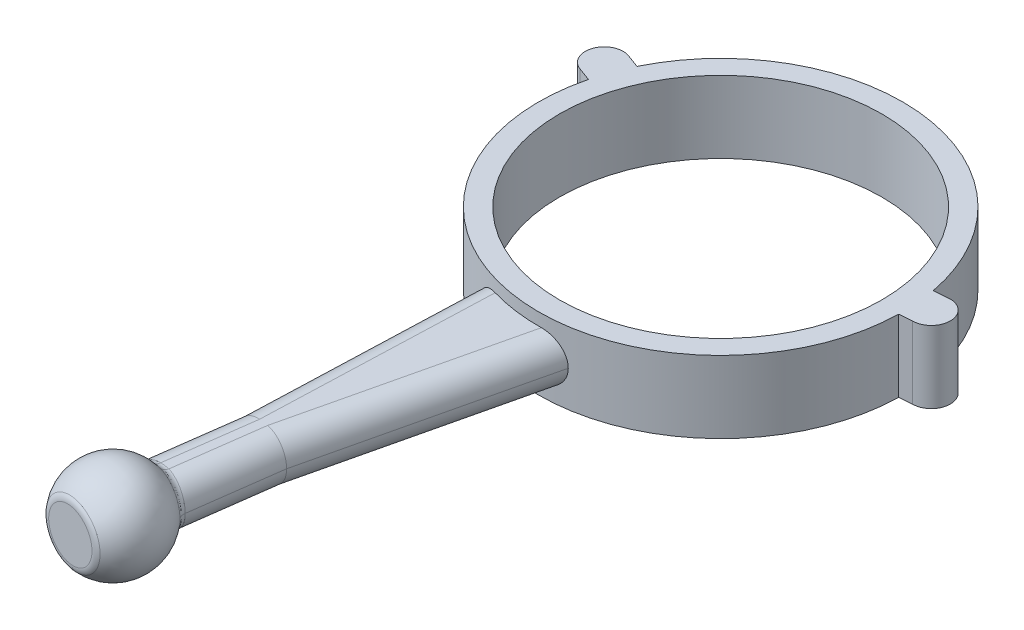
ISO-10303-21;
HEADER;
FILE_DESCRIPTION(('STEP AP214'),'2;1');
FILE_NAME('part.step','',(''),(''),'','','');
FILE_SCHEMA(('AUTOMOTIVE_DESIGN { 1 0 10303 214 1 1 1 1 }'));
ENDSEC;
DATA;
#1=APPLICATION_CONTEXT('core data for automotive mechanical design processes');
#2=APPLICATION_PROTOCOL_DEFINITION('international standard','automotive_design',2000,#1);
#3=PRODUCT_CONTEXT('',#1,'mechanical');
#4=PRODUCT('Part','Part','',(#3));
#5=PRODUCT_RELATED_PRODUCT_CATEGORY('part','',(#4));
#6=PRODUCT_DEFINITION_FORMATION('','',#4);
#7=PRODUCT_DEFINITION_CONTEXT('part definition',#1,'design');
#8=PRODUCT_DEFINITION('design','',#6,#7);
#9=PRODUCT_DEFINITION_SHAPE('','',#8);
#10=(LENGTH_UNIT() NAMED_UNIT(*) SI_UNIT(.MILLI.,.METRE.));
#11=(NAMED_UNIT(*) PLANE_ANGLE_UNIT() SI_UNIT($,.RADIAN.));
#12=(NAMED_UNIT(*) SI_UNIT($,.STERADIAN.) SOLID_ANGLE_UNIT());
#13=UNCERTAINTY_MEASURE_WITH_UNIT(LENGTH_MEASURE(1.E-05),#10,'distance_accuracy_value','');
#14=(GEOMETRIC_REPRESENTATION_CONTEXT(3) GLOBAL_UNCERTAINTY_ASSIGNED_CONTEXT((#13)) GLOBAL_UNIT_ASSIGNED_CONTEXT((#10,
#11,#12)) REPRESENTATION_CONTEXT('',''));
#15=CARTESIAN_POINT('',(0.,0.,0.));
#16=DIRECTION('',(0.,0.,1.));
#17=DIRECTION('',(1.,0.,0.));
#18=AXIS2_PLACEMENT_3D('',#15,#16,#17);
#19=CARTESIAN_POINT('',(-0.0819431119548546,-1.9,-0.996636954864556));
#20=DIRECTION('',(0.0819431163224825,0.,0.996637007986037));
#21=DIRECTION('',(0.996637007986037,0.,-0.0819431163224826));
#22=AXIS2_PLACEMENT_3D('',#19,#20,#21);
#23=PLANE('',#22);
#24=DIRECTION('',(0.,1.,0.));
#25=VECTOR('',#24,1.);
#26=CARTESIAN_POINT('',(9.43116253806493,-1.9,-1.77880088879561));
#27=LINE('',#26,#25);
#28=CARTESIAN_POINT('',(9.43116253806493,-1.9,-1.77880088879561));
#29=VERTEX_POINT('',#28);
#30=CARTESIAN_POINT('',(9.43116253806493,1.9,-1.77880088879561));
#31=VERTEX_POINT('',#30);
#32=EDGE_CURVE('E182',#29,#31,#27,.T.);
#33=ORIENTED_EDGE('',*,*,#32,.T.);
#34=DIRECTION('',(0.996637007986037,0.,-0.0819431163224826));
#35=VECTOR('',#34,1.);
#36=CARTESIAN_POINT('',(-0.0819431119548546,1.9,-0.996636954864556));
#37=LINE('',#36,#35);
#38=CARTESIAN_POINT('',(10.2650850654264,1.9,-1.84736568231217));
#39=VERTEX_POINT('',#38);
#40=EDGE_CURVE('E186',#31,#39,#37,.T.);
#41=ORIENTED_EDGE('',*,*,#40,.T.);
#42=DIRECTION('',(0.,1.,0.));
#43=VECTOR('',#42,1.);
#44=CARTESIAN_POINT('',(10.2650850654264,-1.9,-1.84736568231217));
#45=LINE('',#44,#43);
#46=CARTESIAN_POINT('',(10.2650850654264,-1.9,-1.84736568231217));
#47=VERTEX_POINT('',#46);
#48=EDGE_CURVE('E248',#47,#39,#45,.T.);
#49=ORIENTED_EDGE('',*,*,#48,.F.);
#50=DIRECTION('',(0.996637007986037,0.,-0.0819431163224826));
#51=VECTOR('',#50,1.);
#52=CARTESIAN_POINT('',(-0.0819431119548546,-1.9,-0.996636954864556));
#53=LINE('',#52,#51);
#54=EDGE_CURVE('E187',#29,#47,#53,.T.);
#55=ORIENTED_EDGE('',*,*,#54,.F.);
#56=EDGE_LOOP('',(#33,#41,#49,#55));
#57=FACE_BOUND('',#56,.T.);
#58=ADVANCED_FACE('F37',(#57),#23,.F.);
#59=CARTESIAN_POINT('',(10.2650850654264,-1.9,-0.847365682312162));
#60=DIRECTION('',(0.,1.,0.));
#61=DIRECTION('',(0.,0.,1.));
#62=AXIS2_PLACEMENT_3D('',#59,#60,#61);
#63=CYLINDRICAL_SURFACE('',#62,1.);
#64=ORIENTED_EDGE('',*,*,#48,.T.);
#65=CARTESIAN_POINT('',(10.2650850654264,1.9,-0.847365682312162));
#66=DIRECTION('',(0.,1.,0.));
#67=DIRECTION('',(0.,0.,1.));
#68=AXIS2_PLACEMENT_3D('',#65,#66,#67);
#69=CIRCLE('',#68,1.);
#70=CARTESIAN_POINT('',(10.2650850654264,1.9,0.152634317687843));
#71=VERTEX_POINT('',#70);
#72=EDGE_CURVE('E206',#71,#39,#69,.T.);
#73=ORIENTED_EDGE('',*,*,#72,.F.);
#74=DIRECTION('',(0.,1.,0.));
#75=VECTOR('',#74,1.);
#76=CARTESIAN_POINT('',(10.2650850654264,-1.9,0.152634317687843));
#77=LINE('',#76,#75);
#78=CARTESIAN_POINT('',(10.2650850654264,-1.9,0.152634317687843));
#79=VERTEX_POINT('',#78);
#80=EDGE_CURVE('E251',#79,#71,#77,.T.);
#81=ORIENTED_EDGE('',*,*,#80,.F.);
#82=CARTESIAN_POINT('',(10.2650850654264,-1.9,-0.847365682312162));
#83=DIRECTION('',(0.,1.,0.));
#84=DIRECTION('',(0.,0.,1.));
#85=AXIS2_PLACEMENT_3D('',#82,#83,#84);
#86=CIRCLE('',#85,1.);
#87=EDGE_CURVE('E192',#79,#47,#86,.T.);
#88=ORIENTED_EDGE('',*,*,#87,.T.);
#89=EDGE_LOOP('',(#64,#73,#81,#88));
#90=FACE_BOUND('',#89,.T.);
#91=ADVANCED_FACE('F572',(#90),#63,.T.);
#92=CARTESIAN_POINT('',(0.0825991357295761,-1.9,0.996582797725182));
#93=DIRECTION('',(0.0825991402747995,0.,0.996582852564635));
#94=DIRECTION('',(0.996582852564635,0.,-0.0825991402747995));
#95=AXIS2_PLACEMENT_3D('',#92,#93,#94);
#96=PLANE('',#95);
#97=ORIENTED_EDGE('',*,*,#80,.T.);
#98=DIRECTION('',(0.996582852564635,0.,-0.0825991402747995));
#99=VECTOR('',#98,1.);
#100=CARTESIAN_POINT('',(0.0825991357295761,1.9,0.996582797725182));
#101=LINE('',#100,#99);
#102=CARTESIAN_POINT('',(9.59518786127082,1.9,0.208156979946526));
#103=VERTEX_POINT('',#102);
#104=EDGE_CURVE('E223',#103,#71,#101,.T.);
#105=ORIENTED_EDGE('',*,*,#104,.F.);
#106=DIRECTION('',(0.,1.,0.));
#107=VECTOR('',#106,1.);
#108=CARTESIAN_POINT('',(9.59518786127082,-1.9,0.208156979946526));
#109=LINE('',#108,#107);
#110=CARTESIAN_POINT('',(9.59518786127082,-1.9,0.208156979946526));
#111=VERTEX_POINT('',#110);
#112=EDGE_CURVE('E253',#111,#103,#109,.T.);
#113=ORIENTED_EDGE('',*,*,#112,.F.);
#114=DIRECTION('',(0.996582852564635,0.,-0.0825991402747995));
#115=VECTOR('',#114,1.);
#116=CARTESIAN_POINT('',(0.0825991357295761,-1.9,0.996582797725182));
#117=LINE('',#116,#115);
#118=EDGE_CURVE('E243',#111,#79,#117,.T.);
#119=ORIENTED_EDGE('',*,*,#118,.T.);
#120=EDGE_LOOP('',(#97,#105,#113,#119));
#121=FACE_BOUND('',#120,.T.);
#122=ADVANCED_FACE('F309',(#121),#96,.T.);
#123=CARTESIAN_POINT('',(0.,-1.9,0.));
#124=DIRECTION('',(0.,1.,0.));
#125=DIRECTION('',(0.,0.,1.));
#126=AXIS2_PLACEMENT_3D('',#123,#124,#125);
#127=CYLINDRICAL_SURFACE('',#126,9.59744546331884);
#128=CARTESIAN_POINT('',(0.,-1.25,0.));
#129=DIRECTION('',(0.,-1.,0.));
#130=DIRECTION('',(0.,0.,-1.));
#131=AXIS2_PLACEMENT_3D('',#128,#129,#130);
#132=CIRCLE('',#131,9.59744546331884);
#133=CARTESIAN_POINT('',(-2.67478109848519,-1.25,9.21718533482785));
#134=VERTEX_POINT('',#133);
#135=CARTESIAN_POINT('',(0.139811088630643,-1.25,9.5964270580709));
#136=VERTEX_POINT('',#135);
#137=EDGE_CURVE('E264',#134,#136,#132,.F.);
#138=ORIENTED_EDGE('',*,*,#137,.F.);
#139=CARTESIAN_POINT('',(-2.67478109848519,-1.25,9.21718533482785));
#140=CARTESIAN_POINT('',(-2.7472133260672,-1.25004325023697,9.19620049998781));
#141=CARTESIAN_POINT('',(-2.81933341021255,-1.24358386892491,9.17431251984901));
#142=CARTESIAN_POINT('',(-2.96098223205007,-1.21824365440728,9.1295610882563));
#143=CARTESIAN_POINT('',(-3.03051312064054,-1.19937338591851,9.10669848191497));
#144=CARTESIAN_POINT('',(-3.16514132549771,-1.14979509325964,9.06079181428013));
#145=CARTESIAN_POINT('',(-3.23023895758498,-1.11908791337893,9.0377477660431));
#146=CARTESIAN_POINT('',(-3.35429655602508,-1.0466489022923,8.99244163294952));
#147=CARTESIAN_POINT('',(-3.41325602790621,-1.00491618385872,8.97017961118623));
#148=CARTESIAN_POINT('',(-3.52366484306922,-0.911174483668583,8.92738912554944));
#149=CARTESIAN_POINT('',(-3.57507471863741,-0.859114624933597,8.90686999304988));
#150=CARTESIAN_POINT('',(-3.66840316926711,-0.746102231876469,8.86884000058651));
#151=CARTESIAN_POINT('',(-3.71032193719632,-0.685149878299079,8.85132907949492));
#152=CARTESIAN_POINT('',(-3.78168264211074,-0.558544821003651,8.82107050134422));
#153=CARTESIAN_POINT('',(-3.81154898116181,-0.493169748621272,8.80816313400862));
#154=CARTESIAN_POINT('',(-3.85984688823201,-0.357650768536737,8.78710677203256));
#155=CARTESIAN_POINT('',(-3.87829684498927,-0.287514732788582,8.77895012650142));
#156=CARTESIAN_POINT('',(-3.89680233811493,-0.180550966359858,8.77074292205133));
#157=CARTESIAN_POINT('',(-3.90144258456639,-0.144609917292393,8.7686784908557));
#158=CARTESIAN_POINT('',(-3.90763351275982,-0.0724528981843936,8.76592068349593));
#159=CARTESIAN_POINT('',(-3.90918777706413,-0.0362372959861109,8.76522571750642));
#160=CARTESIAN_POINT('',(-3.90918644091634,0.,8.76522793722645));
#161=B_SPLINE_CURVE_WITH_KNOTS('',3,(#139,#140,#141,#142,#143,#144,#145,#146,#147,#148,#149,
#150,#151,#152,#153,#154,#155,#156,#157,#158,#159,#160),.UNSPECIFIED.,.F.,.F.,(4,2,2,2,2,2,2,2,
2,2,4),(0.,0.225883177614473,0.451574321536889,0.677249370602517,0.902942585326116,
1.12977660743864,1.35660601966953,1.57455052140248,1.79214305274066,1.90089900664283,
2.00952863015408),.UNSPECIFIED.);
#162=CARTESIAN_POINT('',(-3.90918644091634,0.,8.76522793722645));
#163=VERTEX_POINT('',#162);
#164=EDGE_CURVE('E322',#134,#163,#161,.T.);
#165=ORIENTED_EDGE('',*,*,#164,.T.);
#166=CARTESIAN_POINT('',(-3.90918644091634,0.,8.76522793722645));
#167=CARTESIAN_POINT('',(-3.90918747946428,0.0335190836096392,8.76522629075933));
#168=CARTESIAN_POINT('',(-3.90785792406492,0.0670211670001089,8.76582056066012));
#169=CARTESIAN_POINT('',(-3.90256220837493,0.133766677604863,8.76817998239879));
#170=CARTESIAN_POINT('',(-3.89859669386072,0.167010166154,8.76994484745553));
#171=CARTESIAN_POINT('',(-3.88282369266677,0.265780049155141,8.7769458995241));
#172=CARTESIAN_POINT('',(-3.86713929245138,0.330613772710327,8.78388889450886));
#173=CARTESIAN_POINT('',(-3.82603965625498,0.456428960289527,8.80186771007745));
#174=CARTESIAN_POINT('',(-3.80062883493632,0.517412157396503,8.8129016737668));
#175=CARTESIAN_POINT('',(-3.74094884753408,0.634125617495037,8.83839980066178));
#176=CARTESIAN_POINT('',(-3.70667490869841,0.689853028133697,8.85286581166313));
#177=CARTESIAN_POINT('',(-3.62891832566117,0.796711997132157,8.88502897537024));
#178=CARTESIAN_POINT('',(-3.58514611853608,0.847602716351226,8.90282450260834));
#179=CARTESIAN_POINT('',(-3.49042046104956,0.941345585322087,8.94038695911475));
#180=CARTESIAN_POINT('',(-3.43946442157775,0.984194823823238,8.96015459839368));
#181=CARTESIAN_POINT('',(-3.32820470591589,1.06342959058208,9.00209762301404));
#182=CARTESIAN_POINT('',(-3.26751293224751,1.09923193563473,9.0243461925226));
#183=CARTESIAN_POINT('',(-3.14101275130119,1.15991129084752,9.06915087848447));
#184=CARTESIAN_POINT('',(-3.07520582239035,1.18479144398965,9.09170690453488));
#185=CARTESIAN_POINT('',(-2.95376710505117,1.21911330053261,9.13178157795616));
#186=CARTESIAN_POINT('',(-2.89875249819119,1.23065418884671,9.14940053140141));
#187=CARTESIAN_POINT('',(-2.78748134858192,1.24610164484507,9.18391837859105));
#188=CARTESIAN_POINT('',(-2.73122560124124,1.25001296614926,9.20081771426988));
#189=CARTESIAN_POINT('',(-2.67478109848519,1.25,9.21718533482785));
#190=B_SPLINE_CURVE_WITH_KNOTS('',3,(#166,#167,#168,#169,#170,#171,#172,#173,#174,#175,#176,
#177,#178,#179,#180,#181,#182,#183,#184,#185,#186,#187,#188,#189),.UNSPECIFIED.,.F.,.F.,(4,2,2,
2,2,2,2,2,2,2,2,4),(0.,0.100492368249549,0.200960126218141,0.401102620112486,0.601154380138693,
0.801314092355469,1.00875298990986,1.21626684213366,1.43695710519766,1.65758382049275,
1.83381420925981,2.00993476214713),.UNSPECIFIED.);
#191=CARTESIAN_POINT('',(-2.67478109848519,1.25,9.21718533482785));
#192=VERTEX_POINT('',#191);
#193=EDGE_CURVE('E293',#163,#192,#190,.T.);
#194=ORIENTED_EDGE('',*,*,#193,.T.);
#195=CARTESIAN_POINT('',(0.,1.25,0.));
#196=DIRECTION('',(0.,-1.,0.));
#197=DIRECTION('',(0.,0.,-1.));
#198=AXIS2_PLACEMENT_3D('',#195,#196,#197);
#199=CIRCLE('',#198,9.59744546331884);
#200=CARTESIAN_POINT('',(0.139811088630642,1.25,9.59642705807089));
#201=VERTEX_POINT('',#200);
#202=EDGE_CURVE('E250',#192,#201,#199,.F.);
#203=ORIENTED_EDGE('',*,*,#202,.T.);
#204=CARTESIAN_POINT('',(0.139811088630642,1.25,9.59642705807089));
#205=CARTESIAN_POINT('',(0.215214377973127,1.25004325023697,9.59536176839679));
#206=CARTESIAN_POINT('',(0.290555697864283,1.24358386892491,9.59334292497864));
#207=CARTESIAN_POINT('',(0.43899759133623,1.21824365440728,9.58767868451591));
#208=CARTESIAN_POINT('',(0.512100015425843,1.19937338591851,9.58403467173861));
#209=CARTESIAN_POINT('',(0.654077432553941,1.14979509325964,9.57539819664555));
#210=CARTESIAN_POINT('',(0.722952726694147,1.11908791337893,9.57040583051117));
#211=CARTESIAN_POINT('',(0.854577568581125,1.0466489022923,9.55955067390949));
#212=CARTESIAN_POINT('',(0.917326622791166,1.00491618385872,9.55368781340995));
#213=CARTESIAN_POINT('',(1.03512360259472,0.911174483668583,9.54164606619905));
#214=CARTESIAN_POINT('',(1.09013099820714,0.859114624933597,9.53546573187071));
#215=CARTESIAN_POINT('',(1.1901967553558,0.746102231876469,9.52349392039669));
#216=CARTESIAN_POINT('',(1.23525531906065,0.685149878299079,9.51770243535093));
#217=CARTESIAN_POINT('',(1.31207984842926,0.558544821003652,9.50741052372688));
#218=CARTESIAN_POINT('',(1.34429735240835,0.493169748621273,9.50286841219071));
#219=CARTESIAN_POINT('',(1.39644595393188,0.357650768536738,9.49534634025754));
#220=CARTESIAN_POINT('',(1.41639680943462,0.287514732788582,9.49236386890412));
#221=CARTESIAN_POINT('',(1.43641460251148,0.180550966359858,9.4893473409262));
#222=CARTESIAN_POINT('',(1.44143577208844,0.144609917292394,9.48858470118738));
#223=CARTESIAN_POINT('',(1.44813584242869,0.072452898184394,9.48756384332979));
#224=CARTESIAN_POINT('',(1.44981861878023,0.0362372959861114,9.48730504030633));
#225=CARTESIAN_POINT('',(1.44981674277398,0.,9.48730682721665));
#226=B_SPLINE_CURVE_WITH_KNOTS('',3,(#204,#205,#206,#207,#208,#209,#210,#211,#212,#213,#214,
#215,#216,#217,#218,#219,#220,#221,#222,#223,#224,#225),.UNSPECIFIED.,.F.,.F.,(4,2,2,2,2,2,2,2,
2,2,4),(0.,0.225883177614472,0.451574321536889,0.677249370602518,0.902942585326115,
1.12977660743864,1.35660601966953,1.57455052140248,1.79214305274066,1.90089900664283,
2.00952863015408),.UNSPECIFIED.);
#227=CARTESIAN_POINT('',(1.44981674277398,0.,9.48730682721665));
#228=VERTEX_POINT('',#227);
#229=EDGE_CURVE('E286',#201,#228,#226,.T.);
#230=ORIENTED_EDGE('',*,*,#229,.T.);
#231=CARTESIAN_POINT('',(1.44981674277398,0.,9.48730682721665));
#232=CARTESIAN_POINT('',(1.44981818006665,-0.0335190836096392,9.48730551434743));
#233=CARTESIAN_POINT('',(1.44837875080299,-0.0670211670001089,9.48752668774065));
#234=CARTESIAN_POINT('',(1.44264741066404,-0.133766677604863,9.48840030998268));
#235=CARTESIAN_POINT('',(1.43835619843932,-0.167010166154,9.48905265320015));
#236=CARTESIAN_POINT('',(1.42129268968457,-0.265780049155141,9.49162927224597));
#237=CARTESIAN_POINT('',(1.40432998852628,-0.330613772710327,9.49417335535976));
#238=CARTESIAN_POINT('',(1.35993750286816,-0.456428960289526,9.50063285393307));
#239=CARTESIAN_POINT('',(1.33251246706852,-0.517412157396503,9.50454764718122));
#240=CARTESIAN_POINT('',(1.2682120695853,-0.634125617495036,9.51334049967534));
#241=CARTESIAN_POINT('',(1.23133161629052,-0.689853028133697,9.5182190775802));
#242=CARTESIAN_POINT('',(1.14783520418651,-0.796711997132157,9.52865480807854));
#243=CARTESIAN_POINT('',(1.10091397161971,-0.847602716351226,9.53423018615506));
#244=CARTESIAN_POINT('',(0.999624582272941,-0.941345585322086,9.54538132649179));
#245=CARTESIAN_POINT('',(0.945253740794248,-0.984194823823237,9.5509570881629));
#246=CARTESIAN_POINT('',(0.82686050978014,-1.06342959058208,9.56195638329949));
#247=CARTESIAN_POINT('',(0.762444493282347,-1.09923193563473,9.56734777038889));
#248=CARTESIAN_POINT('',(0.628596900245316,-1.15991129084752,9.57707286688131));
#249=CARTESIAN_POINT('',(0.559166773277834,-1.18479144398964,9.58140688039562));
#250=CARTESIAN_POINT('',(0.431452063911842,-1.21911330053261,9.58791030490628));
#251=CARTESIAN_POINT('',(0.373736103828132,-1.23065418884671,9.59033979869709));
#252=CARTESIAN_POINT('',(0.257297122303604,-1.24610164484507,9.59417569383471));
#253=CARTESIAN_POINT('',(0.198574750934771,-1.25001296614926,9.59558273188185));
#254=CARTESIAN_POINT('',(0.139811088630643,-1.25,9.59642705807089));
#255=B_SPLINE_CURVE_WITH_KNOTS('',3,(#231,#232,#233,#234,#235,#236,#237,#238,#239,#240,#241,
#242,#243,#244,#245,#246,#247,#248,#249,#250,#251,#252,#253,#254),.UNSPECIFIED.,.F.,.F.,(4,2,2,
2,2,2,2,2,2,2,2,4),(0.,0.100492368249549,0.200960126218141,0.401102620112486,0.601154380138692,
0.801314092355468,1.00875298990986,1.21626684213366,1.43695710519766,1.65758382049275,
1.83381420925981,2.00993476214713),.UNSPECIFIED.);
#256=EDGE_CURVE('E317',#228,#136,#255,.T.);
#257=ORIENTED_EDGE('',*,*,#256,.T.);
#258=EDGE_LOOP('',(#138,#165,#194,#203,#230,#257));
#259=FACE_BOUND('',#258,.T.);
#260=ORIENTED_EDGE('',*,*,#112,.T.);
#261=CARTESIAN_POINT('',(0.,1.9,0.));
#262=DIRECTION('',(0.,1.,0.));
#263=DIRECTION('',(0.,0.,1.));
#264=AXIS2_PLACEMENT_3D('',#261,#262,#263);
#265=CIRCLE('',#264,9.59744546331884);
#266=CARTESIAN_POINT('',(-9.30886501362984,1.9,-2.33580640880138));
#267=VERTEX_POINT('',#266);
#268=EDGE_CURVE('E220',#267,#103,#265,.T.);
#269=ORIENTED_EDGE('',*,*,#268,.F.);
#270=DIRECTION('',(0.,1.,0.));
#271=VECTOR('',#270,1.);
#272=CARTESIAN_POINT('',(-9.30886501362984,-1.9,-2.33580640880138));
#273=LINE('',#272,#271);
#274=CARTESIAN_POINT('',(-9.30886501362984,-1.9,-2.33580640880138));
#275=VERTEX_POINT('',#274);
#276=EDGE_CURVE('E255',#275,#267,#273,.T.);
#277=ORIENTED_EDGE('',*,*,#276,.F.);
#278=CARTESIAN_POINT('',(0.,-1.9,0.));
#279=DIRECTION('',(0.,1.,0.));
#280=DIRECTION('',(0.,0.,1.));
#281=AXIS2_PLACEMENT_3D('',#278,#279,#280);
#282=CIRCLE('',#281,9.59744546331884);
#283=EDGE_CURVE('E240',#275,#111,#282,.T.);
#284=ORIENTED_EDGE('',*,*,#283,.T.);
#285=EDGE_LOOP('',(#260,#269,#277,#284));
#286=FACE_BOUND('',#285,.T.);
#287=ADVANCED_FACE('F303',(#259,#286),#127,.T.);
#288=CARTESIAN_POINT('',(-0.343114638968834,-1.9,0.939293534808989));
#289=DIRECTION('',(0.343114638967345,0.,-0.939293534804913));
#290=DIRECTION('',(-0.939293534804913,0.,-0.343114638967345));
#291=AXIS2_PLACEMENT_3D('',#288,#289,#290);
#292=PLANE('',#291);
#293=ORIENTED_EDGE('',*,*,#276,.T.);
#294=DIRECTION('',(-0.939293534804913,0.,-0.343114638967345));
#295=VECTOR('',#294,1.);
#296=CARTESIAN_POINT('',(-0.343114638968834,1.9,0.939293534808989));
#297=LINE('',#296,#295);
#298=CARTESIAN_POINT('',(-10.0178380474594,1.9,-2.59478724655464));
#299=VERTEX_POINT('',#298);
#300=EDGE_CURVE('E217',#267,#299,#297,.T.);
#301=ORIENTED_EDGE('',*,*,#300,.T.);
#302=DIRECTION('',(0.,1.,0.));
#303=VECTOR('',#302,1.);
#304=CARTESIAN_POINT('',(-10.0178380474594,-1.9,-2.59478724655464));
#305=LINE('',#304,#303);
#306=CARTESIAN_POINT('',(-10.0178380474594,-1.9,-2.59478724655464));
#307=VERTEX_POINT('',#306);
#308=EDGE_CURVE('E257',#307,#299,#305,.T.);
#309=ORIENTED_EDGE('',*,*,#308,.F.);
#310=DIRECTION('',(-0.939293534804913,0.,-0.343114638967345));
#311=VECTOR('',#310,1.);
#312=CARTESIAN_POINT('',(-0.343114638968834,-1.9,0.939293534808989));
#313=LINE('',#312,#311);
#314=EDGE_CURVE('E238',#275,#307,#313,.T.);
#315=ORIENTED_EDGE('',*,*,#314,.F.);
#316=EDGE_LOOP('',(#293,#301,#309,#315));
#317=FACE_BOUND('',#316,.T.);
#318=ADVANCED_FACE('F308',(#317),#292,.F.);
#319=CARTESIAN_POINT('',(-9.67472340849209,-1.9,-3.53408078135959));
#320=DIRECTION('',(0.,1.,0.));
#321=DIRECTION('',(0.,0.,1.));
#322=AXIS2_PLACEMENT_3D('',#319,#320,#321);
#323=CYLINDRICAL_SURFACE('',#322,1.00000000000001);
#324=ORIENTED_EDGE('',*,*,#308,.T.);
#325=CARTESIAN_POINT('',(-9.67472340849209,1.9,-3.53408078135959));
#326=DIRECTION('',(0.,1.,0.));
#327=DIRECTION('',(0.,0.,1.));
#328=AXIS2_PLACEMENT_3D('',#325,#326,#327);
#329=CIRCLE('',#328,1.00000000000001);
#330=CARTESIAN_POINT('',(-9.28441496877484,1.9,-4.45476494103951));
#331=VERTEX_POINT('',#330);
#332=EDGE_CURVE('E214',#331,#299,#329,.T.);
#333=ORIENTED_EDGE('',*,*,#332,.F.);
#334=DIRECTION('',(0.,1.,0.));
#335=VECTOR('',#334,1.);
#336=CARTESIAN_POINT('',(-9.28441496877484,-1.9,-4.45476494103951));
#337=LINE('',#336,#335);
#338=CARTESIAN_POINT('',(-9.28441496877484,-1.9,-4.45476494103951));
#339=VERTEX_POINT('',#338);
#340=EDGE_CURVE('E259',#339,#331,#337,.T.);
#341=ORIENTED_EDGE('',*,*,#340,.F.);
#342=CARTESIAN_POINT('',(-9.67472340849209,-1.9,-3.53408078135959));
#343=DIRECTION('',(0.,1.,0.));
#344=DIRECTION('',(0.,0.,1.));
#345=AXIS2_PLACEMENT_3D('',#342,#343,#344);
#346=CIRCLE('',#345,1.00000000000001);
#347=EDGE_CURVE('E235',#339,#307,#346,.T.);
#348=ORIENTED_EDGE('',*,*,#347,.T.);
#349=EDGE_LOOP('',(#324,#333,#341,#348));
#350=FACE_BOUND('',#349,.T.);
#351=ADVANCED_FACE('F589',(#350),#323,.T.);
#352=CARTESIAN_POINT('',(0.34299670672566,-1.9,-0.939336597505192));
#353=DIRECTION('',(0.34299670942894,0.,-0.939336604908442));
#354=DIRECTION('',(-0.939336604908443,0.,-0.34299670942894));
#355=AXIS2_PLACEMENT_3D('',#352,#353,#354);
#356=PLANE('',#355);
#357=ORIENTED_EDGE('',*,*,#340,.T.);
#358=DIRECTION('',(-0.939336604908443,0.,-0.34299670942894));
#359=VECTOR('',#358,1.);
#360=CARTESIAN_POINT('',(0.34299670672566,1.9,-0.939336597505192));
#361=LINE('',#360,#359);
#362=CARTESIAN_POINT('',(-8.62316478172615,1.9,-4.21331087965));
#363=VERTEX_POINT('',#362);
#364=EDGE_CURVE('E200',#363,#331,#361,.T.);
#365=ORIENTED_EDGE('',*,*,#364,.F.);
#366=DIRECTION('',(0.,1.,0.));
#367=VECTOR('',#366,1.);
#368=CARTESIAN_POINT('',(-8.62316478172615,-1.9,-4.21331087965));
#369=LINE('',#368,#367);
#370=CARTESIAN_POINT('',(-8.62316478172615,-1.9,-4.21331087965));
#371=VERTEX_POINT('',#370);
#372=EDGE_CURVE('E191',#371,#363,#369,.T.);
#373=ORIENTED_EDGE('',*,*,#372,.F.);
#374=DIRECTION('',(-0.939336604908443,0.,-0.34299670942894));
#375=VECTOR('',#374,1.);
#376=CARTESIAN_POINT('',(0.34299670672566,-1.9,-0.939336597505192));
#377=LINE('',#376,#375);
#378=EDGE_CURVE('E232',#371,#339,#377,.T.);
#379=ORIENTED_EDGE('',*,*,#378,.T.);
#380=EDGE_LOOP('',(#357,#365,#373,#379));
#381=FACE_BOUND('',#380,.T.);
#382=ADVANCED_FACE('F582',(#381),#356,.T.);
#383=CARTESIAN_POINT('',(0.,-1.9,0.));
#384=DIRECTION('',(0.,1.,0.));
#385=DIRECTION('',(0.,0.,1.));
#386=AXIS2_PLACEMENT_3D('',#383,#384,#385);
#387=CYLINDRICAL_SURFACE('',#386,8.5);
#388=CARTESIAN_POINT('',(0.,-1.9,0.));
#389=DIRECTION('',(0.,1.,0.));
#390=DIRECTION('',(0.,0.,1.));
#391=AXIS2_PLACEMENT_3D('',#388,#389,#390);
#392=CIRCLE('',#391,8.5);
#393=CARTESIAN_POINT('',(0.,-1.9,8.5));
#394=VERTEX_POINT('',#393);
#395=EDGE_CURVE('E226',#394,#394,#392,.T.);
#396=CARTESIAN_POINT('',(0.,1.9,0.));
#397=DIRECTION('',(0.,1.,0.));
#398=DIRECTION('',(0.,0.,1.));
#399=AXIS2_PLACEMENT_3D('',#396,#397,#398);
#400=CIRCLE('',#399,8.5);
#401=CARTESIAN_POINT('',(0.,1.9,8.5));
#402=VERTEX_POINT('',#401);
#403=EDGE_CURVE('E207',#402,#402,#400,.T.);
#404=CARTESIAN_POINT('',(0.,-1.9,8.5));
#405=CARTESIAN_POINT('',(0.,-1.86041666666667,8.5));
#406=CARTESIAN_POINT('',(0.,-1.82083333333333,8.5));
#407=CARTESIAN_POINT('',(0.,-1.74166666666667,8.5));
#408=CARTESIAN_POINT('',(0.,-1.70208333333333,8.5));
#409=CARTESIAN_POINT('',(0.,-1.62291666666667,8.5));
#410=CARTESIAN_POINT('',(0.,-1.58333333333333,8.5));
#411=CARTESIAN_POINT('',(0.,-1.50416666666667,8.5));
#412=CARTESIAN_POINT('',(0.,-1.46458333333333,8.5));
#413=CARTESIAN_POINT('',(0.,-1.38541666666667,8.5));
#414=CARTESIAN_POINT('',(0.,-1.34583333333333,8.5));
#415=CARTESIAN_POINT('',(0.,-1.26666666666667,8.5));
#416=CARTESIAN_POINT('',(0.,-1.22708333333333,8.5));
#417=CARTESIAN_POINT('',(0.,-1.14791666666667,8.5));
#418=CARTESIAN_POINT('',(0.,-1.10833333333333,8.5));
#419=CARTESIAN_POINT('',(0.,-1.02916666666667,8.5));
#420=CARTESIAN_POINT('',(0.,-0.989583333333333,8.5));
#421=CARTESIAN_POINT('',(0.,-0.910416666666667,8.5));
#422=CARTESIAN_POINT('',(0.,-0.870833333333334,8.5));
#423=CARTESIAN_POINT('',(0.,-0.791666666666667,8.5));
#424=CARTESIAN_POINT('',(0.,-0.752083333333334,8.5));
#425=CARTESIAN_POINT('',(0.,-0.672916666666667,8.5));
#426=CARTESIAN_POINT('',(0.,-0.633333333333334,8.5));
#427=CARTESIAN_POINT('',(0.,-0.554166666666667,8.5));
#428=CARTESIAN_POINT('',(0.,-0.514583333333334,8.5));
#429=CARTESIAN_POINT('',(0.,-0.435416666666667,8.5));
#430=CARTESIAN_POINT('',(0.,-0.395833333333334,8.5));
#431=CARTESIAN_POINT('',(0.,-0.316666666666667,8.5));
#432=CARTESIAN_POINT('',(0.,-0.277083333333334,8.5));
#433=CARTESIAN_POINT('',(0.,-0.197916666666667,8.5));
#434=CARTESIAN_POINT('',(0.,-0.158333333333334,8.5));
#435=CARTESIAN_POINT('',(0.,-0.0791666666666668,8.5));
#436=CARTESIAN_POINT('',(0.,-0.0395833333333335,8.5));
#437=CARTESIAN_POINT('',(0.,0.0395833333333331,8.5));
#438=CARTESIAN_POINT('',(0.,0.0791666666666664,8.5));
#439=CARTESIAN_POINT('',(0.,0.158333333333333,8.5));
#440=CARTESIAN_POINT('',(0.,0.197916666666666,8.5));
#441=CARTESIAN_POINT('',(0.,0.277083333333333,8.5));
#442=CARTESIAN_POINT('',(0.,0.316666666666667,8.5));
#443=CARTESIAN_POINT('',(0.,0.395833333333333,8.5));
#444=CARTESIAN_POINT('',(0.,0.435416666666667,8.5));
#445=CARTESIAN_POINT('',(0.,0.514583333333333,8.5));
#446=CARTESIAN_POINT('',(0.,0.554166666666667,8.5));
#447=CARTESIAN_POINT('',(0.,0.633333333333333,8.5));
#448=CARTESIAN_POINT('',(0.,0.672916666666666,8.5));
#449=CARTESIAN_POINT('',(0.,0.752083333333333,8.5));
#450=CARTESIAN_POINT('',(0.,0.791666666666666,8.5));
#451=CARTESIAN_POINT('',(0.,0.870833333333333,8.5));
#452=CARTESIAN_POINT('',(0.,0.910416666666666,8.5));
#453=CARTESIAN_POINT('',(0.,0.989583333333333,8.5));
#454=CARTESIAN_POINT('',(0.,1.02916666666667,8.5));
#455=CARTESIAN_POINT('',(0.,1.10833333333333,8.5));
#456=CARTESIAN_POINT('',(0.,1.14791666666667,8.5));
#457=CARTESIAN_POINT('',(0.,1.22708333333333,8.5));
#458=CARTESIAN_POINT('',(0.,1.26666666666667,8.5));
#459=CARTESIAN_POINT('',(0.,1.34583333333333,8.5));
#460=CARTESIAN_POINT('',(0.,1.38541666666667,8.5));
#461=CARTESIAN_POINT('',(0.,1.46458333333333,8.5));
#462=CARTESIAN_POINT('',(0.,1.50416666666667,8.5));
#463=CARTESIAN_POINT('',(0.,1.58333333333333,8.5));
#464=CARTESIAN_POINT('',(0.,1.62291666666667,8.5));
#465=CARTESIAN_POINT('',(0.,1.70208333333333,8.5));
#466=CARTESIAN_POINT('',(0.,1.74166666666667,8.5));
#467=CARTESIAN_POINT('',(0.,1.82083333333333,8.5));
#468=CARTESIAN_POINT('',(0.,1.86041666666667,8.5));
#469=CARTESIAN_POINT('',(0.,1.9,8.5));
#470=B_SPLINE_CURVE_WITH_KNOTS('',3,(#404,#405,#406,#407,#408,#409,#410,#411,#412,#413,#414,
#415,#416,#417,#418,#419,#420,#421,#422,#423,#424,#425,#426,#427,#428,#429,#430,#431,#432,#433,
#434,#435,#436,#437,#438,#439,#440,#441,#442,#443,#444,#445,#446,#447,#448,#449,#450,#451,#452,
#453,#454,#455,#456,#457,#458,#459,#460,#461,#462,#463,#464,#465,#466,#467,#468,#469),
.UNSPECIFIED.,.F.,.F.,(4,2,2,2,2,2,2,2,2,2,2,2,2,2,2,2,2,2,2,2,2,2,2,2,2,2,2,2,2,2,2,2,4),(0.,
0.11875,0.2375,0.35625,0.475,0.59375,0.7125,0.83125,0.95,1.06875,1.1875,1.30625,1.425,1.54375,
1.6625,1.78125,1.9,2.01875,2.1375,2.25625,2.375,2.49375,2.6125,2.73125,2.85,2.96875,3.0875,
3.20625,3.325,3.44375,3.5625,3.68125,3.8),.UNSPECIFIED.);
#471=EDGE_CURVE('BSEAM580',#394,#402,#470,.T.);
#472=ORIENTED_EDGE('',*,*,#395,.F.);
#473=ORIENTED_EDGE('',*,*,#403,.T.);
#474=ORIENTED_EDGE('',*,*,#471,.T.);
#475=ORIENTED_EDGE('',*,*,#471,.F.);
#476=EDGE_LOOP('',(#472,#474,#473,#475));
#477=FACE_BOUND('',#476,.T.);
#478=ADVANCED_FACE('F580',(#477),#387,.F.);
#479=CARTESIAN_POINT('',(0.,-1.9,0.));
#480=DIRECTION('',(0.,1.,0.));
#481=DIRECTION('',(0.,0.,1.));
#482=AXIS2_PLACEMENT_3D('',#479,#480,#481);
#483=CYLINDRICAL_SURFACE('',#482,9.59744546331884);
#484=ORIENTED_EDGE('',*,*,#372,.T.);
#485=CARTESIAN_POINT('',(0.,1.9,0.));
#486=DIRECTION('',(0.,1.,0.));
#487=DIRECTION('',(0.,0.,1.));
#488=AXIS2_PLACEMENT_3D('',#485,#486,#487);
#489=CIRCLE('',#488,9.59744546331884);
#490=EDGE_CURVE('E195',#31,#363,#489,.T.);
#491=ORIENTED_EDGE('',*,*,#490,.F.);
#492=ORIENTED_EDGE('',*,*,#32,.F.);
#493=CARTESIAN_POINT('',(0.,-1.9,0.));
#494=DIRECTION('',(0.,1.,0.));
#495=DIRECTION('',(0.,0.,1.));
#496=AXIS2_PLACEMENT_3D('',#493,#494,#495);
#497=CIRCLE('',#496,9.59744546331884);
#498=EDGE_CURVE('E230',#29,#371,#497,.T.);
#499=ORIENTED_EDGE('',*,*,#498,.T.);
#500=EDGE_LOOP('',(#484,#491,#492,#499));
#501=FACE_BOUND('',#500,.T.);
#502=ADVANCED_FACE('F196',(#501),#483,.T.);
#503=CARTESIAN_POINT('',(0.,-1.9,0.));
#504=DIRECTION('',(0.,1.,0.));
#505=DIRECTION('',(0.,0.,1.));
#506=AXIS2_PLACEMENT_3D('',#503,#504,#505);
#507=PLANE('',#506);
#508=ORIENTED_EDGE('',*,*,#395,.T.);
#509=EDGE_LOOP('',(#508));
#510=FACE_BOUND('',#509,.T.);
#511=ORIENTED_EDGE('',*,*,#54,.T.);
#512=ORIENTED_EDGE('',*,*,#87,.F.);
#513=ORIENTED_EDGE('',*,*,#118,.F.);
#514=ORIENTED_EDGE('',*,*,#283,.F.);
#515=ORIENTED_EDGE('',*,*,#314,.T.);
#516=ORIENTED_EDGE('',*,*,#347,.F.);
#517=ORIENTED_EDGE('',*,*,#378,.F.);
#518=ORIENTED_EDGE('',*,*,#498,.F.);
#519=EDGE_LOOP('',(#511,#512,#513,#514,#515,#516,#517,#518));
#520=FACE_BOUND('',#519,.T.);
#521=ADVANCED_FACE('F588',(#510,#520),#507,.F.);
#522=CARTESIAN_POINT('',(0.,1.9,0.));
#523=DIRECTION('',(0.,1.,0.));
#524=DIRECTION('',(0.,0.,1.));
#525=AXIS2_PLACEMENT_3D('',#522,#523,#524);
#526=PLANE('',#525);
#527=ORIENTED_EDGE('',*,*,#403,.F.);
#528=EDGE_LOOP('',(#527));
#529=FACE_BOUND('',#528,.T.);
#530=ORIENTED_EDGE('',*,*,#40,.F.);
#531=ORIENTED_EDGE('',*,*,#490,.T.);
#532=ORIENTED_EDGE('',*,*,#364,.T.);
#533=ORIENTED_EDGE('',*,*,#332,.T.);
#534=ORIENTED_EDGE('',*,*,#300,.F.);
#535=ORIENTED_EDGE('',*,*,#268,.T.);
#536=ORIENTED_EDGE('',*,*,#104,.T.);
#537=ORIENTED_EDGE('',*,*,#72,.T.);
#538=EDGE_LOOP('',(#530,#531,#532,#533,#534,#535,#536,#537));
#539=FACE_BOUND('',#538,.T.);
#540=ADVANCED_FACE('F203',(#529,#539),#526,.T.);
#541=CARTESIAN_POINT('',(0.,-1.25,0.));
#542=DIRECTION('',(0.,-1.,0.));
#543=DIRECTION('',(0.,0.,-1.));
#544=AXIS2_PLACEMENT_3D('',#541,#542,#543);
#545=PLANE('',#544);
#546=DIRECTION('',(0.133534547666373,0.,-0.991044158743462));
#547=VECTOR('',#546,1.);
#548=CARTESIAN_POINT('',(0.247761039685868,-1.25,0.0333836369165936));
#549=LINE('',#548,#547);
#550=CARTESIAN_POINT('',(-2.61507786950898,-1.25,21.2803180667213));
#551=VERTEX_POINT('',#550);
#552=CARTESIAN_POINT('',(-3.23347646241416,-1.25,25.8698443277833));
#553=VERTEX_POINT('',#552);
#554=EDGE_CURVE('E281',#551,#553,#549,.F.);
#555=ORIENTED_EDGE('',*,*,#554,.T.);
#556=CARTESIAN_POINT('',(-3.80573460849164,-1.25,28.2447585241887));
#557=DIRECTION('',(0.,-1.,0.));
#558=DIRECTION('',(0.,0.,-1.));
#559=AXIS2_PLACEMENT_3D('',#556,#557,#558);
#560=CIRCLE('',#559,2.44288698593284);
#561=CARTESIAN_POINT('',(-3.72899854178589,-1.25,25.8030770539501));
#562=VERTEX_POINT('',#561);
#563=EDGE_CURVE('E557',#553,#562,#560,.F.);
#564=ORIENTED_EDGE('',*,*,#563,.T.);
#565=DIRECTION('',(-0.133534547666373,0.,0.991044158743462));
#566=VECTOR('',#565,1.);
#567=CARTESIAN_POINT('',(-0.247761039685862,-1.25,-0.0333836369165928));
#568=LINE('',#567,#566);
#569=CARTESIAN_POINT('',(-3.11059994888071,-1.25,21.2135507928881));
#570=VERTEX_POINT('',#569);
#571=EDGE_CURVE('E279',#562,#570,#568,.F.);
#572=ORIENTED_EDGE('',*,*,#571,.T.);
#573=DIRECTION('',(-0.0363052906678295,0.,0.999340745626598));
#574=VECTOR('',#573,1.);
#575=CARTESIAN_POINT('',(-2.33684355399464,-1.25,-0.0848957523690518));
#576=LINE('',#575,#574);
#577=EDGE_CURVE('E277',#570,#134,#576,.F.);
#578=ORIENTED_EDGE('',*,*,#577,.T.);
#579=ORIENTED_EDGE('',*,*,#137,.T.);
#580=DIRECTION('',(0.229492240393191,0.,-0.973310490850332));
#581=VECTOR('',#580,1.);
#582=CARTESIAN_POINT('',(2.27597479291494,-1.25,0.536641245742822));
#583=LINE('',#582,#581);
#584=EDGE_CURVE('E284',#136,#551,#583,.F.);
#585=ORIENTED_EDGE('',*,*,#584,.T.);
#586=EDGE_LOOP('',(#555,#564,#572,#578,#579,#585));
#587=FACE_BOUND('',#586,.T.);
#588=ADVANCED_FACE('F525',(#587),#545,.T.);
#589=CARTESIAN_POINT('',(0.,1.25,0.));
#590=DIRECTION('',(0.,-1.,0.));
#591=DIRECTION('',(0.,0.,-1.));
#592=AXIS2_PLACEMENT_3D('',#589,#590,#591);
#593=PLANE('',#592);
#594=DIRECTION('',(-0.133534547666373,0.,0.991044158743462));
#595=VECTOR('',#594,1.);
#596=CARTESIAN_POINT('',(-3.91996110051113,1.25,27.2203307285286));
#597=LINE('',#596,#595);
#598=CARTESIAN_POINT('',(-3.11059994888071,1.25,21.2135507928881));
#599=VERTEX_POINT('',#598);
#600=CARTESIAN_POINT('',(-3.72899854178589,1.25,25.8030770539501));
#601=VERTEX_POINT('',#600);
#602=EDGE_CURVE('E267',#599,#601,#597,.T.);
#603=ORIENTED_EDGE('',*,*,#602,.T.);
#604=CARTESIAN_POINT('',(-3.80573460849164,1.25,28.2447585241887));
#605=DIRECTION('',(0.,-1.,0.));
#606=DIRECTION('',(0.,0.,-1.));
#607=AXIS2_PLACEMENT_3D('',#604,#605,#606);
#608=CIRCLE('',#607,2.44288698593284);
#609=CARTESIAN_POINT('',(-3.23347646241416,1.25,25.8698443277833));
#610=VERTEX_POINT('',#609);
#611=EDGE_CURVE('E58',#601,#610,#608,.T.);
#612=ORIENTED_EDGE('',*,*,#611,.T.);
#613=DIRECTION('',(0.133534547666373,0.,-0.991044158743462));
#614=VECTOR('',#613,1.);
#615=CARTESIAN_POINT('',(-2.62323173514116,1.25,21.340833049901));
#616=LINE('',#615,#614);
#617=CARTESIAN_POINT('',(-2.61507786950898,1.25,21.2803180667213));
#618=VERTEX_POINT('',#617);
#619=EDGE_CURVE('E272',#610,#618,#616,.T.);
#620=ORIENTED_EDGE('',*,*,#619,.T.);
#621=DIRECTION('',(0.229492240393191,0.,-0.973310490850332));
#622=VECTOR('',#621,1.);
#623=CARTESIAN_POINT('',(0.233178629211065,1.25,9.20044152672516));
#624=LINE('',#623,#622);
#625=EDGE_CURVE('E274',#618,#201,#624,.T.);
#626=ORIENTED_EDGE('',*,*,#625,.T.);
#627=ORIENTED_EDGE('',*,*,#202,.F.);
#628=DIRECTION('',(-0.0363052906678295,0.,0.999340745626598));
#629=VECTOR('',#628,1.);
#630=CARTESIAN_POINT('',(-3.10838308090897,1.25,21.1525292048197));
#631=LINE('',#630,#629);
#632=EDGE_CURVE('E269',#192,#599,#631,.T.);
#633=ORIENTED_EDGE('',*,*,#632,.T.);
#634=EDGE_LOOP('',(#603,#612,#620,#626,#627,#633));
#635=FACE_BOUND('',#634,.T.);
#636=ADVANCED_FACE('F338',(#635),#593,.F.);
#637=CARTESIAN_POINT('',(-2.62323173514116,0.,21.340833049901));
#638=DIRECTION('',(0.133534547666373,0.,-0.991044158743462));
#639=DIRECTION('',(-0.991044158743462,0.,-0.133534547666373));
#640=AXIS2_PLACEMENT_3D('',#637,#638,#639);
#641=CYLINDRICAL_SURFACE('',#640,1.25);
#642=DIRECTION('',(0.133534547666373,0.,-0.991044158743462));
#643=VECTOR('',#642,1.);
#644=CARTESIAN_POINT('',(-1.38442653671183,0.,21.507751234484));
#645=LINE('',#644,#643);
#646=CARTESIAN_POINT('',(-2.01967574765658,0.,26.2223365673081));
#647=VERTEX_POINT('',#646);
#648=CARTESIAN_POINT('',(-1.38442653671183,0.,21.507751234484));
#649=VERTEX_POINT('',#648);
#650=EDGE_CURVE('E502',#647,#649,#645,.T.);
#651=ORIENTED_EDGE('',*,*,#650,.F.);
#652=CARTESIAN_POINT('',(-2.08741052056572,0.411891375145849,26.2022436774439));
#653=CARTESIAN_POINT('',(-2.12025375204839,0.41968304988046,26.4256297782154));
#654=CARTESIAN_POINT('',(-1.98331509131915,0.480700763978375,26.5946427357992));
#655=CARTESIAN_POINT('',(-2.06498608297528,0.345858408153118,26.2088890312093));
#656=CARTESIAN_POINT('',(-2.09688066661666,0.352583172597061,26.4318290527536));
#657=CARTESIAN_POINT('',(-1.95698457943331,0.4036365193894,26.6012114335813));
#658=CARTESIAN_POINT('',(-2.04805011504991,0.277844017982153,26.213912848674));
#659=CARTESIAN_POINT('',(-2.07921191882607,0.283301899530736,26.4365190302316));
#660=CARTESIAN_POINT('',(-1.9370983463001,0.324259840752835,26.6061765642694));
#661=CARTESIAN_POINT('',(-2.02540135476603,0.139885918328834,26.220634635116));
#662=CARTESIAN_POINT('',(-2.05558169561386,0.14269550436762,26.4427939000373));
#663=CARTESIAN_POINT('',(-1.91050399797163,0.163254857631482,26.6128193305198));
#664=CARTESIAN_POINT('',(-2.01967997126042,0.069943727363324,26.22233514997));
#665=CARTESIAN_POINT('',(-2.04960035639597,0.0713405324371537,26.4443840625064));
#666=CARTESIAN_POINT('',(-1.90378579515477,0.0816283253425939,26.6144994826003));
#667=CARTESIAN_POINT('',(-2.01967152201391,-0.0699774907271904,26.2223379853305));
#668=CARTESIAN_POINT('',(-2.04958948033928,-0.0713749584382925,26.4443871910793));
#669=CARTESIAN_POINT('',(-1.90377585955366,-0.0816677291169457,26.6145022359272));
#670=CARTESIAN_POINT('',(-2.02538997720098,-0.139956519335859,26.2206386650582));
#671=CARTESIAN_POINT('',(-2.05556571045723,-0.142769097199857,26.4427986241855));
#672=CARTESIAN_POINT('',(-1.91049060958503,-0.163337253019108,26.6128232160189));
#673=CARTESIAN_POINT('',(-2.04808347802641,-0.277907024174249,26.2139022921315));
#674=CARTESIAN_POINT('',(-2.0792508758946,-0.283364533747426,26.4365082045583));
#675=CARTESIAN_POINT('',(-1.9371375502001,-0.324333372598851,26.6061662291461));
#676=CARTESIAN_POINT('',(-2.06505629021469,-0.345878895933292,26.2088659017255));
#677=CARTESIAN_POINT('',(-2.09696847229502,-0.352597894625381,26.4318040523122));
#678=CARTESIAN_POINT('',(-1.95706711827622,-0.403660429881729,26.6011889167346));
#679=CARTESIAN_POINT('',(-2.10974530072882,-0.477846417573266,26.1956272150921));
#680=CARTESIAN_POINT('',(-2.14354024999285,-0.486771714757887,26.4194551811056));
#681=CARTESIAN_POINT('',(-2.00954022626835,-0.55767406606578,26.5881022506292));
#682=CARTESIAN_POINT('',(-2.13745213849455,-0.541845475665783,26.1874276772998));
#683=CARTESIAN_POINT('',(-2.17240540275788,-0.551741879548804,26.4118075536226));
#684=CARTESIAN_POINT('',(-2.04207277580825,-0.632364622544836,26.5799956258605));
#685=CARTESIAN_POINT('',(-2.20286126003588,-0.664238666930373,26.168113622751));
#686=CARTESIAN_POINT('',(-2.24040495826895,-0.675665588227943,26.3938231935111));
#687=CARTESIAN_POINT('',(-2.11887233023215,-0.775204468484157,26.5608940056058));
#688=CARTESIAN_POINT('',(-2.24058024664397,-0.722623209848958,26.1569942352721));
#689=CARTESIAN_POINT('',(-2.27958450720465,-0.734626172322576,26.3834746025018));
#690=CARTESIAN_POINT('',(-2.16315894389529,-0.843342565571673,26.549894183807));
#691=CARTESIAN_POINT('',(-2.32503007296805,-0.832194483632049,26.1321659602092));
#692=CARTESIAN_POINT('',(-2.36708422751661,-0.844881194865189,26.3604120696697));
#693=CARTESIAN_POINT('',(-2.26231020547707,-0.971218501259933,26.5253228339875));
#694=CARTESIAN_POINT('',(-2.37178617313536,-0.883360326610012,26.1184498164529));
#695=CARTESIAN_POINT('',(-2.41546226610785,-0.896160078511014,26.347683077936));
#696=CARTESIAN_POINT('',(-2.31720450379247,-1.03093196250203,26.5117440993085));
#697=CARTESIAN_POINT('',(-2.47282074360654,-0.976804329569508,26.0889017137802));
#698=CARTESIAN_POINT('',(-2.51970193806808,-0.989352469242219,26.320321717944));
#699=CARTESIAN_POINT('',(-2.43582077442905,-1.13998645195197,26.4824783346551));
#700=CARTESIAN_POINT('',(-2.52708709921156,-1.01909653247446,26.0730731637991));
#701=CARTESIAN_POINT('',(-2.57558457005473,-1.03127641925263,26.3056838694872));
#702=CARTESIAN_POINT('',(-2.49952852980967,-1.18934386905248,26.4667947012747));
#703=CARTESIAN_POINT('',(-2.64208633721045,-1.09400264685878,26.0396410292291));
#704=CARTESIAN_POINT('',(-2.69363578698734,-1.10501087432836,26.2748409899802));
#705=CARTESIAN_POINT('',(-2.63453072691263,-1.27676358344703,26.4336518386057));
#706=CARTESIAN_POINT('',(-2.70286180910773,-1.12654676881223,26.0220257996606));
#707=CARTESIAN_POINT('',(-2.75587491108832,-1.13673227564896,26.2586182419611));
#708=CARTESIAN_POINT('',(-2.70587513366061,-1.3147444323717,26.4161809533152));
#709=CARTESIAN_POINT('',(-2.82874257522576,-1.18063640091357,25.9856666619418));
#710=CARTESIAN_POINT('',(-2.88435020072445,-1.18883525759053,26.2252198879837));
#711=CARTESIAN_POINT('',(-2.85364115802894,-1.37787012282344,26.3801005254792));
#712=CARTESIAN_POINT('',(-2.89384388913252,-1.20219186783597,25.9669237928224));
#713=CARTESIAN_POINT('',(-2.95060630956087,-1.20920202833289,26.2080392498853));
#714=CARTESIAN_POINT('',(-2.93005810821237,-1.40302658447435,26.3614920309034));
#715=CARTESIAN_POINT('',(-3.04974900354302,-1.23921213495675,25.9221959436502));
#716=CARTESIAN_POINT('',(-3.10878258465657,-1.24319921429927,26.1671326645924));
#717=CARTESIAN_POINT('',(-3.1130550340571,-1.4462313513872,26.3170606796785));
#718=CARTESIAN_POINT('',(-3.14165365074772,-1.24999061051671,25.895948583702));
#719=CARTESIAN_POINT('',(-3.20157960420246,-1.25197199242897,26.1432177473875));
#720=CARTESIAN_POINT('',(-3.22092479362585,-1.45881044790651,26.2909689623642));
#721=CARTESIAN_POINT('',(-3.30192188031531,-1.25000699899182,25.8503860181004));
#722=CARTESIAN_POINT('',(-3.36251915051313,-1.24852495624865,26.1018831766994));
#723=CARTESIAN_POINT('',(-3.40902461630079,-1.45882957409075,26.2456442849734));
#724=CARTESIAN_POINT('',(-3.37032182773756,-1.24403034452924,25.8310072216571));
#725=CARTESIAN_POINT('',(-3.43098296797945,-1.24103821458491,26.0843450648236));
#726=CARTESIAN_POINT('',(-3.48929970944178,-1.45185447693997,26.2263563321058));
#727=CARTESIAN_POINT('',(-3.50548339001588,-1.22032455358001,25.7928336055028));
#728=CARTESIAN_POINT('',(-3.56580795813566,-1.21447915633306,26.049887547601));
#729=CARTESIAN_POINT('',(-3.64792183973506,-1.42418846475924,26.188343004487));
#730=CARTESIAN_POINT('',(-3.57223770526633,-1.20255037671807,25.7740413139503));
#731=CARTESIAN_POINT('',(-3.63214742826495,-1.19532916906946,26.0329742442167));
#732=CARTESIAN_POINT('',(-3.72626028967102,-1.4034449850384,26.1696200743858));
#733=CARTESIAN_POINT('',(-3.63712240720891,-1.17900926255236,25.7558320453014));
#734=CARTESIAN_POINT('',(-3.69628428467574,-1.17062582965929,26.0166594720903));
#735=CARTESIAN_POINT('',(-3.80240218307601,-1.37597115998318,26.1514691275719));
#736=(BOUNDED_SURFACE() B_SPLINE_SURFACE(3,2,((#652,#653,#654),(#655,#656,#657),(#658,#659,
#660),(#661,#662,#663),(#664,#665,#666),(#667,#668,#669),(#670,#671,#672),(#673,#674,#675),
(#676,#677,#678),(#679,#680,#681),(#682,#683,#684),(#685,#686,#687),(#688,#689,#690),(#691,#692,
#693),(#694,#695,#696),(#697,#698,#699),(#700,#701,#702),(#703,#704,#705),(#706,#707,#708),
(#709,#710,#711),(#712,#713,#714),(#715,#716,#717),(#718,#719,#720),(#721,#722,#723),(#724,#725,
#726),(#727,#728,#729),(#730,#731,#732),(#733,#734,#735)),.UNSPECIFIED.,.F.,.F.,
.F.) B_SPLINE_SURFACE_WITH_KNOTS((4,2,2,2,2,2,2,2,2,2,2,2,2,4),(3,3),(0.,0.293644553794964,
0.587064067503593,0.880625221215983,1.17412813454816,1.46737567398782,1.76111553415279,
2.05568864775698,2.34979201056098,2.64595321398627,2.94184558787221,3.34009446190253,
3.63695218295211,3.93494981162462),(0.,1.),
.UNSPECIFIED.) GEOMETRIC_REPRESENTATION_ITEM() RATIONAL_B_SPLINE_SURFACE(((1.,0.911291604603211,
1.),(1.,0.91171349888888,1.),(1.,0.912031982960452,1.),(1.,0.912457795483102,1.),(1.,
0.912565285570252,1.),(1.,0.912565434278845,1.),(1.,0.912457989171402,1.),(1.,0.912031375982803,
1.),(1.,0.911712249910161,1.),(1.,0.910871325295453,1.),(1.,0.910349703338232,1.),(1.,
0.909116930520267,1.),(1.,0.908405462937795,1.),(1.,0.906810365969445,1.),(1.,0.905926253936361,
1.),(1.,0.904012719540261,1.),(1.,0.902983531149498,1.),(1.,0.900798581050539,1.),(1.,
0.899641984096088,1.),(1.,0.897241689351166,1.),(1.,0.895998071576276,1.),(1.,0.893013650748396,
1.),(1.,0.891249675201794,1.),(1.,0.888164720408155,1.),(1.,0.886845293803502,1.),(1.,
0.884232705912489,1.),(1.,0.882939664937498,1.),(1.,0.881680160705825,1.))) REPRESENTATION_ITEM('') SURFACE());
#737=CARTESIAN_POINT('',(-2.08741052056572,0.411891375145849,26.2022436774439));
#738=CARTESIAN_POINT('',(-2.06498608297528,0.345858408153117,26.2088890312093));
#739=CARTESIAN_POINT('',(-2.04805011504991,0.277844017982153,26.213912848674));
#740=CARTESIAN_POINT('',(-2.02540135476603,0.139885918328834,26.220634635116));
#741=CARTESIAN_POINT('',(-2.01967997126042,0.069943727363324,26.22233514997));
#742=CARTESIAN_POINT('',(-2.01967152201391,-0.0699774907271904,26.2223379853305));
#743=CARTESIAN_POINT('',(-2.02538997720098,-0.139956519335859,26.2206386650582));
#744=CARTESIAN_POINT('',(-2.04808347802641,-0.277907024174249,26.2139022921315));
#745=CARTESIAN_POINT('',(-2.06505629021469,-0.345878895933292,26.2088659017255));
#746=CARTESIAN_POINT('',(-2.10974530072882,-0.477846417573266,26.1956272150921));
#747=CARTESIAN_POINT('',(-2.13745213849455,-0.541845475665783,26.1874276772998));
#748=CARTESIAN_POINT('',(-2.20286126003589,-0.664238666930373,26.168113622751));
#749=CARTESIAN_POINT('',(-2.24058024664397,-0.722623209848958,26.1569942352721));
#750=CARTESIAN_POINT('',(-2.32503007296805,-0.832194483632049,26.1321659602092));
#751=CARTESIAN_POINT('',(-2.37178617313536,-0.883360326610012,26.1184498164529));
#752=CARTESIAN_POINT('',(-2.47282074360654,-0.976804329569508,26.0889017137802));
#753=CARTESIAN_POINT('',(-2.52708709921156,-1.01909653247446,26.0730731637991));
#754=CARTESIAN_POINT('',(-2.64208633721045,-1.09400264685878,26.0396410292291));
#755=CARTESIAN_POINT('',(-2.70286180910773,-1.12654676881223,26.0220257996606));
#756=CARTESIAN_POINT('',(-2.82874257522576,-1.18063640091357,25.9856666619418));
#757=CARTESIAN_POINT('',(-2.89384388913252,-1.20219186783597,25.9669237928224));
#758=CARTESIAN_POINT('',(-3.04974900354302,-1.23921213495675,25.9221959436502));
#759=CARTESIAN_POINT('',(-3.14165365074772,-1.24999061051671,25.895948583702));
#760=CARTESIAN_POINT('',(-3.30192188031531,-1.25000699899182,25.8503860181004));
#761=CARTESIAN_POINT('',(-3.37032182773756,-1.24403034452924,25.8310072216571));
#762=CARTESIAN_POINT('',(-3.50548339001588,-1.22032455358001,25.7928336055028));
#763=CARTESIAN_POINT('',(-3.57223770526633,-1.20255037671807,25.7740413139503));
#764=CARTESIAN_POINT('',(-3.63712240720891,-1.17900926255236,25.7558320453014));
#765=B_SPLINE_CURVE_WITH_KNOTS('',3,(#737,#738,#739,#740,#741,#742,#743,#744,#745,#746,#747,
#748,#749,#750,#751,#752,#753,#754,#755,#756,#757,#758,#759,#760,#761,#762,#763,#764),
.UNSPECIFIED.,.F.,.F.,(4,2,2,2,2,2,2,2,2,2,2,2,2,4),(0.,0.293644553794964,0.587064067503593,
0.880625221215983,1.17412813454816,1.46737567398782,1.76111553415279,2.05568864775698,
2.34979201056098,2.64595321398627,2.94184558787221,3.34009446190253,3.63695218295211,
3.93494981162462),.UNSPECIFIED.);
#766=EDGE_CURVE('E345',#647,#553,#765,.T.);
#767=ORIENTED_EDGE('',*,*,#766,.T.);
#768=ORIENTED_EDGE('',*,*,#554,.F.);
#769=CARTESIAN_POINT('',(-2.61507786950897,0.,21.2803180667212));
#770=DIRECTION('',(0.181729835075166,0.,-0.983348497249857));
#771=DIRECTION('',(0.983348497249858,0.,0.181729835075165));
#772=AXIS2_PLACEMENT_3D('',#769,#770,#771);
#773=ELLIPSE('',#772,1.25149053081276,1.25);
#774=EDGE_CURVE('E210',#649,#551,#773,.T.);
#775=ORIENTED_EDGE('',*,*,#774,.F.);
#776=EDGE_LOOP('',(#651,#767,#768,#775));
#777=FACE_BOUND('',#776,.T.);
#778=ADVANCED_FACE('F333',(#777),#641,.T.);
#779=CARTESIAN_POINT('',(0.233178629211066,0.,9.20044152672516));
#780=DIRECTION('',(0.229492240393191,0.,-0.973310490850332));
#781=DIRECTION('',(-0.973310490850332,0.,-0.229492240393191));
#782=AXIS2_PLACEMENT_3D('',#779,#780,#781);
#783=CYLINDRICAL_SURFACE('',#782,1.25);
#784=ORIENTED_EDGE('',*,*,#584,.F.);
#785=ORIENTED_EDGE('',*,*,#256,.F.);
#786=DIRECTION('',(0.229492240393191,0.,-0.973310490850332));
#787=VECTOR('',#786,1.);
#788=CARTESIAN_POINT('',(1.44981674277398,0.,9.48730682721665));
#789=LINE('',#788,#787);
#790=EDGE_CURVE('E504',#649,#228,#789,.T.);
#791=ORIENTED_EDGE('',*,*,#790,.F.);
#792=ORIENTED_EDGE('',*,*,#774,.T.);
#793=EDGE_LOOP('',(#784,#785,#791,#792));
#794=FACE_BOUND('',#793,.T.);
#795=ADVANCED_FACE('F328',(#794),#783,.T.);
#796=CARTESIAN_POINT('',(0.247761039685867,0.,0.0333836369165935));
#797=DIRECTION('',(-0.133534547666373,0.,0.991044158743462));
#798=DIRECTION('',(0.991044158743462,0.,0.133534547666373));
#799=AXIS2_PLACEMENT_3D('',#796,#797,#798);
#800=CYLINDRICAL_SURFACE('',#799,1.25);
#801=ORIENTED_EDGE('',*,*,#619,.F.);
#802=CARTESIAN_POINT('',(-3.63712240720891,1.17900926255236,25.7558320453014));
#803=CARTESIAN_POINT('',(-3.69628428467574,1.17062582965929,26.0166594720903));
#804=CARTESIAN_POINT('',(-3.80240218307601,1.37597115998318,26.1514691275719));
#805=CARTESIAN_POINT('',(-3.57237767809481,1.20252482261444,25.7740016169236));
#806=CARTESIAN_POINT('',(-3.63228898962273,1.19530171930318,26.0329379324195));
#807=CARTESIAN_POINT('',(-3.72642456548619,1.40341516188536,26.1695805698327));
#808=CARTESIAN_POINT('',(-3.50571080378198,1.22027473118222,25.7927693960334));
#809=CARTESIAN_POINT('',(-3.56603515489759,1.21442507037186,26.0498294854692));
#810=CARTESIAN_POINT('',(-3.64818872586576,1.42413031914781,26.188279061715));
#811=CARTESIAN_POINT('',(-3.37051649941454,1.24400597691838,25.8309522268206));
#812=CARTESIAN_POINT('',(-3.43117685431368,1.24100917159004,26.0842955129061));
#813=CARTESIAN_POINT('',(-3.4895281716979,1.45182603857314,26.2263015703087));
#814=CARTESIAN_POINT('',(-3.30199044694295,1.24999579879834,25.8503668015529));
#815=CARTESIAN_POINT('',(-3.36258608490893,1.24851159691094,26.1018661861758));
#816=CARTESIAN_POINT('',(-3.40910507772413,1.45881650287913,26.2456251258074));
#817=CARTESIAN_POINT('',(-3.16486431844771,1.25000420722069,25.8893497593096));
#818=CARTESIAN_POINT('',(-3.22482062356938,1.25148611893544,26.1372484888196));
#819=CARTESIAN_POINT('',(-3.24816615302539,1.45882631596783,26.2844046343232));
#820=CARTESIAN_POINT('',(-3.09626427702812,1.2440056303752,25.9089183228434));
#821=CARTESIAN_POINT('',(-3.15564544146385,1.24697669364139,26.1550601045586));
#822=CARTESIAN_POINT('',(-3.16765035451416,1.45182563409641,26.3038607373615));
#823=CARTESIAN_POINT('',(-2.96104675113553,1.22019259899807,25.9476217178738));
#824=CARTESIAN_POINT('',(-3.01883532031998,1.22591424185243,26.1903789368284));
#825=CARTESIAN_POINT('',(-3.00893986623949,1.42403446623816,26.3423213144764));
#826=CARTESIAN_POINT('',(-2.89442892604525,1.20238018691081,25.9667566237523));
#827=CARTESIAN_POINT('',(-2.95118914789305,1.20939712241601,26.2078887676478));
#828=CARTESIAN_POINT('',(-2.93074477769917,1.4032463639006,26.3613258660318));
#829=CARTESIAN_POINT('',(-2.76509497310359,1.15544588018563,26.0040293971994));
#830=CARTESIAN_POINT('',(-2.8194651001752,1.1646908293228,26.2420725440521));
#831=CARTESIAN_POINT('',(-2.77892890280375,1.34847134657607,26.3983257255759));
#832=CARTESIAN_POINT('',(-2.70237630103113,1.12633145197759,26.0221679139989));
#833=CARTESIAN_POINT('',(-2.75536387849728,1.13653754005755,26.2587522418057));
#834=CARTESIAN_POINT('',(-2.70530513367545,1.31449314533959,26.4163216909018));
#835=CARTESIAN_POINT('',(-2.58247784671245,1.05754257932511,26.0569513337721));
#836=CARTESIAN_POINT('',(-2.63251021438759,1.06921853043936,26.2907976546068));
#837=CARTESIAN_POINT('',(-2.56455477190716,1.2342126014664,26.4508152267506));
#838=CARTESIAN_POINT('',(-2.5253074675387,1.01785062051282,26.0735936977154));
#839=CARTESIAN_POINT('',(-2.57373759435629,1.03005383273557,26.306168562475));
#840=CARTESIAN_POINT('',(-2.49743920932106,1.18788981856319,26.4673102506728));
#841=CARTESIAN_POINT('',(-2.41838117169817,0.929129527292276,26.1048074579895));
#842=CARTESIAN_POINT('',(-2.46358720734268,0.941889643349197,26.3350398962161));
#843=CARTESIAN_POINT('',(-2.37190848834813,1.08434723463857,26.4982344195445));
#844=CARTESIAN_POINT('',(-2.36861033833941,0.880119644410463,26.1193830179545));
#845=CARTESIAN_POINT('',(-2.41216143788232,0.89291900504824,26.3485526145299));
#846=CARTESIAN_POINT('',(-2.31347582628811,1.02714990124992,26.5126677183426));
#847=CARTESIAN_POINT('',(-2.27786348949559,0.774181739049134,26.1460215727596));
#848=CARTESIAN_POINT('',(-2.31825203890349,0.786577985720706,26.3732746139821));
#849=CARTESIAN_POINT('',(-2.20693313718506,0.903514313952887,26.5390367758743));
#850=CARTESIAN_POINT('',(-2.23687267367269,0.717267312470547,26.158088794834));
#851=CARTESIAN_POINT('',(-2.27571962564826,0.729218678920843,26.3844965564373));
#852=CARTESIAN_POINT('',(-2.15880573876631,0.837091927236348,26.5509767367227));
#853=CARTESIAN_POINT('',(-2.16491996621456,0.597298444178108,26.1793096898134));
#854=CARTESIAN_POINT('',(-2.20098545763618,0.607946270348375,26.4042434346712));
#855=CARTESIAN_POINT('',(-2.07432420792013,0.697081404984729,26.5719680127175));
#856=CARTESIAN_POINT('',(-2.13391933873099,0.534268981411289,26.1884746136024));
#857=CARTESIAN_POINT('',(-2.1687136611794,0.544045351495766,26.4127867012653));
#858=CARTESIAN_POINT('',(-2.03792460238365,0.623522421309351,26.5810304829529));
#859=CARTESIAN_POINT('',(-2.08266311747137,0.403782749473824,26.2036463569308));
#860=CARTESIAN_POINT('',(-2.11533004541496,0.411513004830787,26.4269326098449));
#861=CARTESIAN_POINT('',(-1.97774093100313,0.471237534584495,26.5960298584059));
#862=CARTESIAN_POINT('',(-2.06239610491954,0.336330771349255,26.2096565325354));
#863=CARTESIAN_POINT('',(-2.09418281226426,0.34286247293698,26.4325446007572));
#864=CARTESIAN_POINT('',(-1.95394345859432,0.392517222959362,26.6019700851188));
#865=CARTESIAN_POINT('',(-2.02913493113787,0.179786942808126,26.219525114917));
#866=CARTESIAN_POINT('',(-2.05948449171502,0.183412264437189,26.4417564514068));
#867=CARTESIAN_POINT('',(-1.91488805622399,0.209821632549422,26.6117230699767));
#868=CARTESIAN_POINT('',(-2.01968153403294,0.0898519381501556,26.2223348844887));
#869=CARTESIAN_POINT('',(-2.04960071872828,0.091645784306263,26.4443841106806));
#870=CARTESIAN_POINT('',(-1.90378762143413,0.10486234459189,26.6144991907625));
#871=CARTESIAN_POINT('',(-2.01967124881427,-0.0698588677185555,26.2223378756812));
#872=CARTESIAN_POINT('',(-2.04959041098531,-0.0712535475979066,26.4443868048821));
#873=CARTESIAN_POINT('',(-1.90377554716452,-0.0815292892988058,26.6145021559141));
#874=CARTESIAN_POINT('',(-2.02537772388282,-0.139667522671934,26.2206417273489));
#875=CARTESIAN_POINT('',(-2.05555656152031,-0.142472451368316,26.4428006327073));
#876=CARTESIAN_POINT('',(-1.91047624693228,-0.162999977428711,26.6128263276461));
#877=CARTESIAN_POINT('',(-2.0479976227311,-0.277599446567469,26.2139283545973));
#878=CARTESIAN_POINT('',(-2.07915757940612,-0.283053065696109,26.4365334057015));
#879=CARTESIAN_POINT('',(-1.93703671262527,-0.323974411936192,26.6061918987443));
#880=CARTESIAN_POINT('',(-2.06495710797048,-0.345714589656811,26.2088974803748));
#881=CARTESIAN_POINT('',(-2.09685133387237,-0.352437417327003,26.4318367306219));
#882=CARTESIAN_POINT('',(-1.95695056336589,-0.403468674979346,26.6012198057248));
#883=CARTESIAN_POINT('',(-2.08741052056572,-0.411891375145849,26.2022436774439));
#884=CARTESIAN_POINT('',(-2.12025375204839,-0.41968304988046,26.4256297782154));
#885=CARTESIAN_POINT('',(-1.98331509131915,-0.480700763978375,26.5946427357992));
#886=(BOUNDED_SURFACE() B_SPLINE_SURFACE(3,2,((#802,#803,#804),(#805,#806,#807),(#808,#809,
#810),(#811,#812,#813),(#814,#815,#816),(#817,#818,#819),(#820,#821,#822),(#823,#824,#825),
(#826,#827,#828),(#829,#830,#831),(#832,#833,#834),(#835,#836,#837),(#838,#839,#840),(#841,#842,
#843),(#844,#845,#846),(#847,#848,#849),(#850,#851,#852),(#853,#854,#855),(#856,#857,#858),
(#859,#860,#861),(#862,#863,#864),(#865,#866,#867),(#868,#869,#870),(#871,#872,#873),(#874,#875,
#876),(#877,#878,#879),(#880,#881,#882),(#883,#884,#885)),.UNSPECIFIED.,.F.,.F.,
.F.) B_SPLINE_SURFACE_WITH_KNOTS((4,2,2,2,2,2,2,2,2,2,2,2,2,4),(3,3),(0.,0.297535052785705,
0.594855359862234,0.892601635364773,1.19029644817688,1.48779492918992,1.78578910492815,
2.08317416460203,2.38005391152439,2.67576828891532,2.9711674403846,3.34793019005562,
3.64085897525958,3.93499425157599),(0.,1.),
.UNSPECIFIED.) GEOMETRIC_REPRESENTATION_ITEM() RATIONAL_B_SPLINE_SURFACE(((1.,0.881680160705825,
1.),(1.,0.882936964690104,1.),(1.,0.884228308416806,1.),(1.,0.886841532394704,1.),(1.,
0.888163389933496,1.),(1.,0.89080291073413,1.),(1.,0.892120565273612,1.),(1.,0.894712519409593,
1.),(1.,0.895986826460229,1.),(1.,0.898456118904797,1.),(1.,0.899651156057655,1.),(1.,
0.901931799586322,1.),(1.,0.903017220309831,1.),(1.,0.905044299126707,1.),(1.,0.905986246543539,
1.),(1.,0.907701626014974,1.),(1.,0.908475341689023,1.),(1.,0.909832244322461,1.),(1.,
0.91041616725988,1.),(1.,0.911381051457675,1.),(1.,0.911762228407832,1.),(1.,0.912387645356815,
1.),(1.,0.912565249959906,1.),(1.,0.912565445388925,1.),(1.,0.912458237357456,1.),(1.,
0.912032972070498,1.),(1.,0.911714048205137,1.),(1.,0.91129160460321,1.))) REPRESENTATION_ITEM('') SURFACE());
#887=CARTESIAN_POINT('',(-3.63712240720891,1.17900926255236,25.7558320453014));
#888=CARTESIAN_POINT('',(-3.57237767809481,1.20252482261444,25.7740016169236));
#889=CARTESIAN_POINT('',(-3.50571080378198,1.22027473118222,25.7927693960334));
#890=CARTESIAN_POINT('',(-3.37051649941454,1.24400597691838,25.8309522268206));
#891=CARTESIAN_POINT('',(-3.30199044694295,1.24999579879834,25.8503668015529));
#892=CARTESIAN_POINT('',(-3.16486431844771,1.25000420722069,25.8893497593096));
#893=CARTESIAN_POINT('',(-3.09626427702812,1.2440056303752,25.9089183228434));
#894=CARTESIAN_POINT('',(-2.96104675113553,1.22019259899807,25.9476217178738));
#895=CARTESIAN_POINT('',(-2.89442892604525,1.20238018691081,25.9667566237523));
#896=CARTESIAN_POINT('',(-2.76509497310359,1.15544588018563,26.0040293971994));
#897=CARTESIAN_POINT('',(-2.70237630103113,1.12633145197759,26.0221679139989));
#898=CARTESIAN_POINT('',(-2.58247784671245,1.05754257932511,26.0569513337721));
#899=CARTESIAN_POINT('',(-2.5253074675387,1.01785062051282,26.0735936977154));
#900=CARTESIAN_POINT('',(-2.41838117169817,0.929129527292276,26.1048074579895));
#901=CARTESIAN_POINT('',(-2.36861033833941,0.880119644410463,26.1193830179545));
#902=CARTESIAN_POINT('',(-2.27786348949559,0.774181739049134,26.1460215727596));
#903=CARTESIAN_POINT('',(-2.23687267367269,0.717267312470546,26.158088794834));
#904=CARTESIAN_POINT('',(-2.16491996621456,0.597298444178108,26.1793096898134));
#905=CARTESIAN_POINT('',(-2.13391933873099,0.534268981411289,26.1884746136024));
#906=CARTESIAN_POINT('',(-2.08266311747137,0.403782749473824,26.2036463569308));
#907=CARTESIAN_POINT('',(-2.06239610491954,0.336330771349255,26.2096565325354));
#908=CARTESIAN_POINT('',(-2.02913493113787,0.179786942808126,26.219525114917));
#909=CARTESIAN_POINT('',(-2.01968153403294,0.0898519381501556,26.2223348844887));
#910=CARTESIAN_POINT('',(-2.01967124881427,-0.0698588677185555,26.2223378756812));
#911=CARTESIAN_POINT('',(-2.02537772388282,-0.139667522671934,26.2206417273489));
#912=CARTESIAN_POINT('',(-2.0479976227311,-0.277599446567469,26.2139283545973));
#913=CARTESIAN_POINT('',(-2.06495710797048,-0.345714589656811,26.2088974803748));
#914=CARTESIAN_POINT('',(-2.08741052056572,-0.411891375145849,26.2022436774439));
#915=B_SPLINE_CURVE_WITH_KNOTS('',3,(#887,#888,#889,#890,#891,#892,#893,#894,#895,#896,#897,
#898,#899,#900,#901,#902,#903,#904,#905,#906,#907,#908,#909,#910,#911,#912,#913,#914),
.UNSPECIFIED.,.F.,.F.,(4,2,2,2,2,2,2,2,2,2,2,2,2,4),(0.,0.297535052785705,0.594855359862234,
0.892601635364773,1.19029644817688,1.48779492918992,1.78578910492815,2.08317416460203,
2.38005391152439,2.67576828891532,2.9711674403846,3.34793019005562,3.64085897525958,
3.93499425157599),.UNSPECIFIED.);
#916=EDGE_CURVE('E50',#610,#647,#915,.T.);
#917=ORIENTED_EDGE('',*,*,#916,.T.);
#918=ORIENTED_EDGE('',*,*,#650,.T.);
#919=CARTESIAN_POINT('',(-2.61507786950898,0.,21.2803180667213));
#920=DIRECTION('',(-0.181729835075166,0.,0.983348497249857));
#921=DIRECTION('',(-0.983348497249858,0.,-0.181729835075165));
#922=AXIS2_PLACEMENT_3D('',#919,#920,#921);
#923=ELLIPSE('',#922,1.25149053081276,1.25);
#924=EDGE_CURVE('E492',#618,#649,#923,.F.);
#925=ORIENTED_EDGE('',*,*,#924,.F.);
#926=EDGE_LOOP('',(#801,#917,#918,#925));
#927=FACE_BOUND('',#926,.T.);
#928=ADVANCED_FACE('F332',(#927),#800,.T.);
#929=CARTESIAN_POINT('',(2.27597479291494,0.,0.536641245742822));
#930=DIRECTION('',(-0.229492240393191,0.,0.973310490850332));
#931=DIRECTION('',(0.973310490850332,0.,0.229492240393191));
#932=AXIS2_PLACEMENT_3D('',#929,#930,#931);
#933=CYLINDRICAL_SURFACE('',#932,1.25);
#934=ORIENTED_EDGE('',*,*,#924,.T.);
#935=ORIENTED_EDGE('',*,*,#790,.T.);
#936=ORIENTED_EDGE('',*,*,#229,.F.);
#937=ORIENTED_EDGE('',*,*,#625,.F.);
#938=EDGE_LOOP('',(#934,#935,#936,#937));
#939=FACE_BOUND('',#938,.T.);
#940=ADVANCED_FACE('F299',(#939),#933,.T.);
#941=CARTESIAN_POINT('',(-3.11875381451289,0.,21.2740657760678));
#942=DIRECTION('',(-0.133534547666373,0.,0.991044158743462));
#943=DIRECTION('',(0.991044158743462,0.,0.133534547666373));
#944=AXIS2_PLACEMENT_3D('',#941,#942,#943);
#945=CYLINDRICAL_SURFACE('',#944,1.25);
#946=ORIENTED_EDGE('',*,*,#571,.F.);
#947=CARTESIAN_POINT('',(-3.30957134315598,-1.17900926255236,25.7999666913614));
#948=CARTESIAN_POINT('',(-3.32155444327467,-1.17062582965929,26.067151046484));
#949=CARTESIAN_POINT('',(-3.2549020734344,-1.37597115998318,26.2252399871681));
#950=CARTESIAN_POINT('',(-3.37681615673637,-1.20252482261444,25.8003518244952));
#951=CARTESIAN_POINT('',(-3.3875760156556,-1.19530171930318,26.0659108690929));
#952=CARTESIAN_POINT('',(-3.3329637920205,-1.40341516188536,26.2225959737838));
#953=CARTESIAN_POINT('',(-3.44607289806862,-1.22027473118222,25.8008050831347));
#954=CARTESIAN_POINT('',(-3.45593785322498,-1.21442507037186,26.0646641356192));
#955=CARTESIAN_POINT('',(-3.4133585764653,-1.42413031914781,26.2199203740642));
#956=CARTESIAN_POINT('',(-3.58655190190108,-1.24400597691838,25.8018433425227));
#957=CARTESIAN_POINT('',(-3.59510908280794,-1.24100917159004,26.0622070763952));
#958=CARTESIAN_POINT('',(-3.57642452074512,-1.45182603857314,26.2145930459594));
#959=CARTESIAN_POINT('',(-3.65777270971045,-1.24999579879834,25.8024282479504));
#960=CARTESIAN_POINT('',(-3.66590426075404,-1.24851159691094,26.0609967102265));
#961=CARTESIAN_POINT('',(-3.65909399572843,-1.45881650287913,26.2119413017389));
#962=CARTESIAN_POINT('',(-3.80032641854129,-1.25000420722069,25.8037267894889));
#963=CARTESIAN_POINT('',(-3.80812149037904,-1.25148611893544,26.0586537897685));
#964=CARTESIAN_POINT('',(-3.82455741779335,-1.45882631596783,26.20674094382));
#965=CARTESIAN_POINT('',(-3.87165933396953,-1.2440056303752,25.8044406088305));
#966=CARTESIAN_POINT('',(-3.87954401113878,-1.24697669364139,26.0575210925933));
#967=CARTESIAN_POINT('',(-3.90735137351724,-1.45182563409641,26.204192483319));
#968=CARTESIAN_POINT('',(-4.01229851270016,-1.22019259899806,25.8059747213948));
#969=CARTESIAN_POINT('',(-4.0208231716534,-1.22591424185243,26.055369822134));
#970=CARTESIAN_POINT('',(-4.07058141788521,-1.42403446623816,26.1992743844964));
#971=CARTESIAN_POINT('',(-4.08160512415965,-1.20238018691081,25.8067949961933));
#972=CARTESIAN_POINT('',(-4.09069133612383,-1.20939712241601,26.0543507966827));
#973=CARTESIAN_POINT('',(-4.15101791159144,-1.4032463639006,26.1969047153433));
#974=CARTESIAN_POINT('',(-4.21619190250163,-1.15544588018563,25.8085067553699));
#975=CARTESIAN_POINT('',(-4.2267653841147,-1.1646908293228,26.0524511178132));
#976=CARTESIAN_POINT('',(-4.30721260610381,-1.34847134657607,26.1924028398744));
#977=CARTESIAN_POINT('',(-4.28147469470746,-1.12633145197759,25.8093981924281));
#978=CARTESIAN_POINT('',(-4.29299530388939,-1.13653754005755,26.0515698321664));
#979=CARTESIAN_POINT('',(-4.38297385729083,-1.31449314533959,26.190270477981));
#980=CARTESIAN_POINT('',(-4.40630359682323,-1.05754257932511,25.8112067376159));
#981=CARTESIAN_POINT('',(-4.41994933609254,-1.06921853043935,26.0499558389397));
#982=CARTESIAN_POINT('',(-4.52783430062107,-1.23421260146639,26.186280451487));
#983=CARTESIAN_POINT('',(-4.46583996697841,-1.01785062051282,25.8121238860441));
#984=CARTESIAN_POINT('',(-4.48069428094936,-1.03005383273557,26.0492227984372));
#985=CARTESIAN_POINT('',(-4.59692218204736,-1.18788981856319,26.1844232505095));
#986=CARTESIAN_POINT('',(-4.5772145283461,-0.929129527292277,25.813923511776));
#987=CARTESIAN_POINT('',(-4.59455796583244,-0.941889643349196,26.0479101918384));
#988=CARTESIAN_POINT('',(-4.72616103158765,-1.08434723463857,26.1810194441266));
#989=CARTESIAN_POINT('',(-4.62906820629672,-0.880119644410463,25.8148060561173));
#990=CARTESIAN_POINT('',(-4.64772624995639,-0.892919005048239,26.0473297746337));
#991=CARTESIAN_POINT('',(-4.78632997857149,-1.02714990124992,26.1794722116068));
#992=CARTESIAN_POINT('',(-4.72362937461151,-0.774181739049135,25.8164759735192));
#993=CARTESIAN_POINT('',(-4.74482991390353,-0.786577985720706,26.0463144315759));
#994=CARTESIAN_POINT('',(-4.8960523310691,-0.903514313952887,26.176701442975));
#995=CARTESIAN_POINT('',(-4.76635225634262,-0.717267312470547,25.8172635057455));
#996=CARTESIAN_POINT('',(-4.78881568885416,-0.729218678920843,26.0458788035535));
#997=CARTESIAN_POINT('',(-4.9456236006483,-0.837091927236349,26.1754773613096));
#998=CARTESIAN_POINT('',(-4.84135560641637,-0.597298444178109,25.8186833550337));
#999=CARTESIAN_POINT('',(-4.86611116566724,-0.607946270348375,26.0451410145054));
#1000=CARTESIAN_POINT('',(-5.03264818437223,-0.69708140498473,26.1733596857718));
#1001=CARTESIAN_POINT('',(-4.87367640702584,-0.53426898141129,25.8193162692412));
#1002=CARTESIAN_POINT('',(-4.89949326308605,-0.544045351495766,26.0448379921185));
#1003=CARTESIAN_POINT('',(-5.07014830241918,-0.623522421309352,26.1724648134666));
#1004=CARTESIAN_POINT('',(-4.92712029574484,-0.403782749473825,25.820380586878));
#1005=CARTESIAN_POINT('',(-4.95471716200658,-0.411513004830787,26.0443499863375));
#1006=CARTESIAN_POINT('',(-5.1321556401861,-0.471237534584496,26.1710000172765));
#1007=CARTESIAN_POINT('',(-4.94825528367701,-0.336330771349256,25.8208122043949));
#1008=CARTESIAN_POINT('',(-4.97659558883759,-0.342862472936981,26.0441646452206));
#1009=CARTESIAN_POINT('',(-5.15667666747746,-0.392517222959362,26.1704297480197));
#1010=CARTESIAN_POINT('',(-4.98294225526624,-0.179786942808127,25.8215253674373));
#1011=CARTESIAN_POINT('',(-5.01249463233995,-0.183412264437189,26.043864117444));
#1012=CARTESIAN_POINT('',(-5.19692063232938,-0.209821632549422,26.1694978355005));
#1013=CARTESIAN_POINT('',(-4.99280219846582,-0.0898519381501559,25.8217328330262));
#1014=CARTESIAN_POINT('',(-5.02272140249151,-0.091645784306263,26.0437820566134));
#1015=CARTESIAN_POINT('',(-5.20835996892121,-0.10486234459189,26.1692369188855));
#1016=CARTESIAN_POINT('',(-4.99281290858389,0.0698588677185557,25.8217329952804));
#1017=CARTESIAN_POINT('',(-5.02273205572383,0.0712535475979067,26.0437819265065));
#1018=CARTESIAN_POINT('',(-5.20837239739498,0.081529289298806,26.1692365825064));
#1019=CARTESIAN_POINT('',(-4.9868610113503,0.139667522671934,25.8216077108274));
#1020=CARTESIAN_POINT('',(-5.01655885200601,0.142472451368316,26.0438314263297));
#1021=CARTESIAN_POINT('',(-5.20146711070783,0.162999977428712,26.1693940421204));
#1022=CARTESIAN_POINT('',(-4.96327092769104,0.277599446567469,25.8211207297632));
#1023=CARTESIAN_POINT('',(-4.99214072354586,0.283053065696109,26.0440343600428));
#1024=CARTESIAN_POINT('',(-5.17409788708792,0.323974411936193,26.1700261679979));
#1025=CARTESIAN_POINT('',(-4.94558470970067,0.345714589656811,25.8207580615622));
#1026=CARTESIAN_POINT('',(-4.97383487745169,0.352437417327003,26.0441883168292));
#1027=CARTESIAN_POINT('',(-5.1535782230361,0.403468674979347,26.170502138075));
#1028=CARTESIAN_POINT('',(-4.9221709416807,0.411891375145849,25.8202844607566));
#1029=CARTESIAN_POINT('',(-4.94962421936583,0.41968304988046,26.0443968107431));
#1030=CARTESIAN_POINT('',(-5.126413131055,0.480700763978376,26.171137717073));
#1031=(BOUNDED_SURFACE() B_SPLINE_SURFACE(3,2,((#947,#948,#949),(#950,#951,#952),(#953,#954,
#955),(#956,#957,#958),(#959,#960,#961),(#962,#963,#964),(#965,#966,#967),(#968,#969,#970),
(#971,#972,#973),(#974,#975,#976),(#977,#978,#979),(#980,#981,#982),(#983,#984,#985),(#986,#987,
#988),(#989,#990,#991),(#992,#993,#994),(#995,#996,#997),(#998,#999,#1000),(#1001,#1002,#1003),
(#1004,#1005,#1006),(#1007,#1008,#1009),(#1010,#1011,#1012),(#1013,#1014,#1015),(#1016,#1017,
#1018),(#1019,#1020,#1021),(#1022,#1023,#1024),(#1025,#1026,#1027),(#1028,#1029,#1030)),
.UNSPECIFIED.,.F.,.F.,.F.) B_SPLINE_SURFACE_WITH_KNOTS((4,2,2,2,2,2,2,2,2,2,2,2,2,4),(3,3),(0.,
0.297535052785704,0.594855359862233,0.892601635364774,1.19029644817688,1.48779492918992,
1.78578910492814,2.08317416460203,2.38005391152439,2.67576828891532,2.9711674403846,
3.34793019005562,3.64085897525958,3.93499425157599),(0.,1.),
.UNSPECIFIED.) GEOMETRIC_REPRESENTATION_ITEM() RATIONAL_B_SPLINE_SURFACE(((1.,0.881680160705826,
1.),(1.,0.882936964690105,1.),(1.,0.884228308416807,1.),(1.,0.886841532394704,1.),(1.,
0.888163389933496,1.),(1.,0.890802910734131,1.),(1.,0.892120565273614,1.),(1.,0.894712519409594,
1.),(1.,0.895986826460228,1.),(1.,0.898456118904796,1.),(1.,0.899651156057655,1.),(1.,
0.901931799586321,1.),(1.,0.903017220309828,1.),(1.,0.905044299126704,1.),(1.,0.905986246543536,
1.),(1.,0.907701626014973,1.),(1.,0.908475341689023,1.),(1.,0.909832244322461,1.),(1.,
0.910416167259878,1.),(1.,0.911381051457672,1.),(1.,0.91176222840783,1.),(1.,0.912387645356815,
1.),(1.,0.912565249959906,1.),(1.,0.912565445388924,1.),(1.,0.912458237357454,1.),(1.,
0.912032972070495,1.),(1.,0.911714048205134,1.),(1.,0.911291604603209,1.))) REPRESENTATION_ITEM('') SURFACE());
#1032=CARTESIAN_POINT('',(-3.30957134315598,-1.17900926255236,25.7999666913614));
#1033=CARTESIAN_POINT('',(-3.37681615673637,-1.20252482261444,25.8003518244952));
#1034=CARTESIAN_POINT('',(-3.44607289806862,-1.22027473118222,25.8008050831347));
#1035=CARTESIAN_POINT('',(-3.58655190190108,-1.24400597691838,25.8018433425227));
#1036=CARTESIAN_POINT('',(-3.65777270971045,-1.24999579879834,25.8024282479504));
#1037=CARTESIAN_POINT('',(-3.80032641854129,-1.25000420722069,25.8037267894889));
#1038=CARTESIAN_POINT('',(-3.87165933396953,-1.2440056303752,25.8044406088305));
#1039=CARTESIAN_POINT('',(-4.01229851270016,-1.22019259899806,25.8059747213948));
#1040=CARTESIAN_POINT('',(-4.08160512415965,-1.20238018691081,25.8067949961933));
#1041=CARTESIAN_POINT('',(-4.21619190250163,-1.15544588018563,25.8085067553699));
#1042=CARTESIAN_POINT('',(-4.28147469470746,-1.12633145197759,25.809398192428));
#1043=CARTESIAN_POINT('',(-4.40630359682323,-1.05754257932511,25.8112067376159));
#1044=CARTESIAN_POINT('',(-4.46583996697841,-1.01785062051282,25.8121238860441));
#1045=CARTESIAN_POINT('',(-4.5772145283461,-0.929129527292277,25.813923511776));
#1046=CARTESIAN_POINT('',(-4.62906820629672,-0.880119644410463,25.8148060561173));
#1047=CARTESIAN_POINT('',(-4.72362937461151,-0.774181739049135,25.8164759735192));
#1048=CARTESIAN_POINT('',(-4.76635225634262,-0.717267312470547,25.8172635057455));
#1049=CARTESIAN_POINT('',(-4.84135560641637,-0.597298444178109,25.8186833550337));
#1050=CARTESIAN_POINT('',(-4.87367640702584,-0.53426898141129,25.8193162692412));
#1051=CARTESIAN_POINT('',(-4.92712029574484,-0.403782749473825,25.820380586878));
#1052=CARTESIAN_POINT('',(-4.94825528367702,-0.336330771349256,25.8208122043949));
#1053=CARTESIAN_POINT('',(-4.98294225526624,-0.179786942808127,25.8215253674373));
#1054=CARTESIAN_POINT('',(-4.99280219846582,-0.0898519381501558,25.8217328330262));
#1055=CARTESIAN_POINT('',(-4.99281290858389,0.0698588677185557,25.8217329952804));
#1056=CARTESIAN_POINT('',(-4.9868610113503,0.139667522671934,25.8216077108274));
#1057=CARTESIAN_POINT('',(-4.96327092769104,0.277599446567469,25.8211207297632));
#1058=CARTESIAN_POINT('',(-4.94558470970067,0.345714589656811,25.8207580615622));
#1059=CARTESIAN_POINT('',(-4.9221709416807,0.411891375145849,25.8202844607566));
#1060=B_SPLINE_CURVE_WITH_KNOTS('',3,(#1032,#1033,#1034,#1035,#1036,#1037,#1038,#1039,#1040,
#1041,#1042,#1043,#1044,#1045,#1046,#1047,#1048,#1049,#1050,#1051,#1052,#1053,#1054,#1055,#1056,
#1057,#1058,#1059),.UNSPECIFIED.,.F.,.F.,(4,2,2,2,2,2,2,2,2,2,2,2,2,4),(0.,0.297535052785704,
0.594855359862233,0.892601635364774,1.19029644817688,1.48779492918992,1.78578910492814,
2.08317416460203,2.38005391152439,2.67576828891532,2.9711674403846,3.34793019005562,
3.64085897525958,3.93499425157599),.UNSPECIFIED.);
#1061=CARTESIAN_POINT('',(-4.99280822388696,0.,25.821732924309));
#1062=VERTEX_POINT('',#1061);
#1063=EDGE_CURVE('E449',#562,#1062,#1060,.T.);
#1064=ORIENTED_EDGE('',*,*,#1063,.T.);
#1065=DIRECTION('',(-0.133534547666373,0.,0.991044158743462));
#1066=VECTOR('',#1065,1.);
#1067=CARTESIAN_POINT('',(-4.35755901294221,0.,21.1071475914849));
#1068=LINE('',#1067,#1066);
#1069=CARTESIAN_POINT('',(-4.35755901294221,0.,21.1071475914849));
#1070=VERTEX_POINT('',#1069);
#1071=EDGE_CURVE('E493',#1070,#1062,#1068,.T.);
#1072=ORIENTED_EDGE('',*,*,#1071,.F.);
#1073=CARTESIAN_POINT('',(-3.11059994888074,0.,21.2135507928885));
#1074=DIRECTION('',(-0.0850211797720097,0.,0.996379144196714));
#1075=DIRECTION('',(-0.996379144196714,0.,-0.0850211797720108));
#1076=AXIS2_PLACEMENT_3D('',#1073,#1074,#1075);
#1077=ELLIPSE('',#1076,1.25149053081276,1.25);
#1078=EDGE_CURVE('E490',#570,#1070,#1077,.F.);
#1079=ORIENTED_EDGE('',*,*,#1078,.F.);
#1080=EDGE_LOOP('',(#946,#1064,#1072,#1079));
#1081=FACE_BOUND('',#1080,.T.);
#1082=ADVANCED_FACE('F420',(#1081),#945,.T.);
#1083=CARTESIAN_POINT('',(-2.6600105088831,0.,8.81060955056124));
#1084=DIRECTION('',(-0.0363052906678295,0.,0.999340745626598));
#1085=DIRECTION('',(0.999340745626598,0.,0.0363052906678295));
#1086=AXIS2_PLACEMENT_3D('',#1083,#1084,#1085);
#1087=CYLINDRICAL_SURFACE('',#1086,1.25);
#1088=ORIENTED_EDGE('',*,*,#577,.F.);
#1089=ORIENTED_EDGE('',*,*,#1078,.T.);
#1090=DIRECTION('',(-0.0363052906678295,0.,0.999340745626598));
#1091=VECTOR('',#1090,1.);
#1092=CARTESIAN_POINT('',(-3.90918644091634,0.,8.76522793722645));
#1093=LINE('',#1092,#1091);
#1094=EDGE_CURVE('E495',#163,#1070,#1093,.T.);
#1095=ORIENTED_EDGE('',*,*,#1094,.F.);
#1096=ORIENTED_EDGE('',*,*,#164,.F.);
#1097=EDGE_LOOP('',(#1088,#1089,#1095,#1096));
#1098=FACE_BOUND('',#1097,.T.);
#1099=ADVANCED_FACE('F440',(#1098),#1087,.T.);
#1100=CARTESIAN_POINT('',(-0.247761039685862,0.,-0.0333836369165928));
#1101=DIRECTION('',(0.133534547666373,0.,-0.991044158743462));
#1102=DIRECTION('',(-0.991044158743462,0.,-0.133534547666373));
#1103=AXIS2_PLACEMENT_3D('',#1100,#1101,#1102);
#1104=CYLINDRICAL_SURFACE('',#1103,1.25);
#1105=ORIENTED_EDGE('',*,*,#1071,.T.);
#1106=CARTESIAN_POINT('',(-4.9221709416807,-0.411891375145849,25.8202844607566));
#1107=CARTESIAN_POINT('',(-4.94962421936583,-0.41968304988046,26.0443968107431));
#1108=CARTESIAN_POINT('',(-5.126413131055,-0.480700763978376,26.171137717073));
#1109=CARTESIAN_POINT('',(-4.94555453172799,-0.345858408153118,25.8207575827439));
#1110=CARTESIAN_POINT('',(-4.9738045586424,-0.352583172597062,26.0441886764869));
#1111=CARTESIAN_POINT('',(-5.15354320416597,-0.4036365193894,26.1705030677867));
#1112=CARTESIAN_POINT('',(-4.96321620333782,-0.277844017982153,25.8211196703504));
#1113=CARTESIAN_POINT('',(-4.99208451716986,-0.283301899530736,26.0440348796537));
#1114=CARTESIAN_POINT('',(-5.17403439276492,-0.324259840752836,26.1700276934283));
#1115=CARTESIAN_POINT('',(-4.98683634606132,-0.139885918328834,25.8216071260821));
#1116=CARTESIAN_POINT('',(-5.0165328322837,-0.14269550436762,26.0438315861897));
#1117=CARTESIAN_POINT('',(-5.20143849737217,-0.163254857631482,26.1693946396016));
#1118=CARTESIAN_POINT('',(-4.99280377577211,-0.0699437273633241,25.8217326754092));
#1119=CARTESIAN_POINT('',(-5.02272173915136,-0.0713405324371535,26.0437819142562));
#1120=CARTESIAN_POINT('',(-5.2083618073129,-0.081628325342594,26.1692367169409));
#1121=CARTESIAN_POINT('',(-4.99281267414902,0.0699774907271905,25.8217331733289));
#1122=CARTESIAN_POINT('',(-5.02273305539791,0.0713749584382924,26.04378205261));
#1123=CARTESIAN_POINT('',(-5.20837211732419,0.0816677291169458,26.1692367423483));
#1124=CARTESIAN_POINT('',(-4.98684838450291,0.139956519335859,25.8216080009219));
#1125=CARTESIAN_POINT('',(-5.01654949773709,0.142769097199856,26.0438319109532));
#1126=CARTESIAN_POINT('',(-5.20145243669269,0.163337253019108,26.1693948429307));
#1127=CARTESIAN_POINT('',(-4.96318123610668,0.277907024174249,25.8211183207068));
#1128=CARTESIAN_POINT('',(-4.99204408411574,0.283364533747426,26.0440347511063));
#1129=CARTESIAN_POINT('',(-5.17399385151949,0.324333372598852,26.1700281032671));
#1130=CARTESIAN_POINT('',(-4.94548070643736,0.345878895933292,25.820753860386));
#1131=CARTESIAN_POINT('',(-4.97371326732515,0.352597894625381,26.044187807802));
#1132=CARTESIAN_POINT('',(-5.1534576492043,0.40366042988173,26.1705032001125));
#1133=CARTESIAN_POINT('',(-4.8988814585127,0.477846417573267,25.819815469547));
#1134=CARTESIAN_POINT('',(-4.92553391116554,0.486771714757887,26.0446058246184));
#1135=CARTESIAN_POINT('',(-5.09939214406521,0.557674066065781,26.1717716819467));
#1136=CARTESIAN_POINT('',(-4.86999249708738,0.541845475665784,25.8192417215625));
#1137=CARTESIAN_POINT('',(-4.89567402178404,0.551741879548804,26.0448708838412));
#1138=CARTESIAN_POINT('',(-5.06587416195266,0.632364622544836,26.1725647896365));
#1139=CARTESIAN_POINT('',(-4.80180406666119,0.664238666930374,25.8179287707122));
#1140=CARTESIAN_POINT('',(-4.8253394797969,0.675665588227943,26.0455258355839));
#1141=CARTESIAN_POINT('',(-4.98675774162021,0.775204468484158,26.1744714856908));
#1142=CARTESIAN_POINT('',(-4.76248720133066,0.722623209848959,25.8171892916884));
#1143=CARTESIAN_POINT('',(-4.78481815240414,0.734626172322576,26.0459162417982));
#1144=CARTESIAN_POINT('',(-4.94113911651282,0.843342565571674,26.1755856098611));
#1145=CARTESIAN_POINT('',(-4.67447762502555,0.83219448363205,25.8155984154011));
#1146=CARTESIAN_POINT('',(-4.69433480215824,0.84488119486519,26.0468353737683));
#1147=CARTESIAN_POINT('',(-4.83902040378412,0.971218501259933,26.1781336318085));
#1148=CARTESIAN_POINT('',(-4.62575863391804,0.883360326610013,25.8147467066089));
#1149=CARTESIAN_POINT('',(-4.64431299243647,0.896160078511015,26.0473649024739));
#1150=CARTESIAN_POINT('',(-4.78248981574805,1.03093196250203,26.1795684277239));
#1151=CARTESIAN_POINT('',(-4.52050654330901,0.976804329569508,25.8129939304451));
#1152=CARTESIAN_POINT('',(-4.53654888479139,0.989352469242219,26.0485692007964));
#1153=CARTESIAN_POINT('',(-4.66035776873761,1.13998645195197,26.1827413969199));
#1154=CARTESIAN_POINT('',(-4.4639860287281,1.01909653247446,25.8120929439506));
#1155=CARTESIAN_POINT('',(-4.47878488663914,1.03127641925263,26.0492442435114));
#1156=CARTESIAN_POINT('',(-4.59477091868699,1.18934386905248,26.1844790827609));
#1157=CARTESIAN_POINT('',(-4.34423927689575,1.09400264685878,25.8102907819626));
#1158=CARTESIAN_POINT('',(-4.35678031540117,1.10501087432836,26.0507467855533));
#1159=CARTESIAN_POINT('',(-4.45581113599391,1.27676358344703,26.1882502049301));
#1160=CARTESIAN_POINT('',(-4.28096888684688,1.12654676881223,25.8093896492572));
#1161=CARTESIAN_POINT('',(-4.29246702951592,1.13673227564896,26.0515758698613));
#1162=CARTESIAN_POINT('',(-4.38238693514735,1.3147444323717,26.1902856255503));
#1163=CARTESIAN_POINT('',(-4.14995396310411,1.18063640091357,25.8076449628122));
#1164=CARTESIAN_POINT('',(-4.1597337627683,1.18883525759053,26.0533730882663));
#1165=CARTESIAN_POINT('',(-4.23034101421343,1.37787012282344,26.1946022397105));
#1166=CARTESIAN_POINT('',(-4.0822135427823,1.20219186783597,25.8068013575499));
#1167=CARTESIAN_POINT('',(-4.09129321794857,1.20920202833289,26.0543416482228));
#1168=CARTESIAN_POINT('',(-4.15172407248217,1.40302658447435,26.1968832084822));
#1169=CARTESIAN_POINT('',(-3.92003001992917,1.23921213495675,25.8049331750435));
#1170=CARTESIAN_POINT('',(-3.92793093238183,1.24319921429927,26.0567595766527));
#1171=CARTESIAN_POINT('',(-3.96349338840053,1.4462313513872,26.2024715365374));
#1172=CARTESIAN_POINT('',(-3.82445588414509,1.24999061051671,25.8039469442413));
#1173=CARTESIAN_POINT('',(-3.83211359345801,1.25197199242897,26.0582587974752));
#1174=CARTESIAN_POINT('',(-3.85256469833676,1.45881044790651,26.205861));
#1175=CARTESIAN_POINT('',(-3.65784391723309,1.25000699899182,25.8024286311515));
#1176=CARTESIAN_POINT('',(-3.66597330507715,1.24852495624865,26.060995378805));
#1177=CARTESIAN_POINT('',(-3.65917665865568,1.45882957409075,26.2119384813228));
#1178=CARTESIAN_POINT('',(-3.58675418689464,1.24403034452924,25.8018448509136));
#1179=CARTESIAN_POINT('',(-3.59530916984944,1.24103821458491,26.06220354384));
#1180=CARTESIAN_POINT('',(-3.57665932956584,1.45185447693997,26.2145853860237));
#1181=CARTESIAN_POINT('',(-3.44630919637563,1.22032455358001,25.8008068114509));
#1182=CARTESIAN_POINT('',(-3.4561723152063,1.21447915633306,26.064659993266));
#1183=CARTESIAN_POINT('',(-3.41363286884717,1.42418846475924,26.2199113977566));
#1184=CARTESIAN_POINT('',(-3.37696164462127,1.20255037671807,25.8003530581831));
#1185=CARTESIAN_POINT('',(-3.38772213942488,1.19532916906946,26.065908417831));
#1186=CARTESIAN_POINT('',(-3.33313266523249,1.4034449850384,26.2225905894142));
#1187=CARTESIAN_POINT('',(-3.30957134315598,1.17900926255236,25.7999666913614));
#1188=CARTESIAN_POINT('',(-3.32155444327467,1.17062582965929,26.067151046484));
#1189=CARTESIAN_POINT('',(-3.2549020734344,1.37597115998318,26.2252399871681));
#1190=(BOUNDED_SURFACE() B_SPLINE_SURFACE(3,2,((#1106,#1107,#1108),(#1109,#1110,#1111),(#1112,
#1113,#1114),(#1115,#1116,#1117),(#1118,#1119,#1120),(#1121,#1122,#1123),(#1124,#1125,#1126),
(#1127,#1128,#1129),(#1130,#1131,#1132),(#1133,#1134,#1135),(#1136,#1137,#1138),(#1139,#1140,
#1141),(#1142,#1143,#1144),(#1145,#1146,#1147),(#1148,#1149,#1150),(#1151,#1152,#1153),(#1154,
#1155,#1156),(#1157,#1158,#1159),(#1160,#1161,#1162),(#1163,#1164,#1165),(#1166,#1167,#1168),
(#1169,#1170,#1171),(#1172,#1173,#1174),(#1175,#1176,#1177),(#1178,#1179,#1180),(#1181,#1182,
#1183),(#1184,#1185,#1186),(#1187,#1188,#1189)),.UNSPECIFIED.,.F.,.F.,
.F.) B_SPLINE_SURFACE_WITH_KNOTS((4,2,2,2,2,2,2,2,2,2,2,2,2,4),(3,3),(0.,0.293644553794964,
0.587064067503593,0.880625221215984,1.17412813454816,1.46737567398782,1.76111553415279,
2.05568864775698,2.34979201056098,2.64595321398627,2.94184558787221,3.34009446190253,
3.63695218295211,3.93494981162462),(0.,1.),
.UNSPECIFIED.) GEOMETRIC_REPRESENTATION_ITEM() RATIONAL_B_SPLINE_SURFACE(((1.,0.911291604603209,
1.),(1.,0.911713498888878,1.),(1.,0.912031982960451,1.),(1.,0.912457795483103,1.),(1.,
0.912565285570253,1.),(1.,0.912565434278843,1.),(1.,0.912457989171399,1.),(1.,0.9120313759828,
1.),(1.,0.911712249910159,1.),(1.,0.910871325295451,1.),(1.,0.91034970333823,1.),(1.,
0.909116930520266,1.),(1.,0.908405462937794,1.),(1.,0.906810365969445,1.),(1.,0.905926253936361,
1.),(1.,0.904012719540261,1.),(1.,0.902983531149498,1.),(1.,0.900798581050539,1.),(1.,
0.899641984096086,1.),(1.,0.897241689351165,1.),(1.,0.895998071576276,1.),(1.,0.893013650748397,
1.),(1.,0.891249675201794,1.),(1.,0.888164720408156,1.),(1.,0.886845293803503,1.),(1.,
0.884232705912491,1.),(1.,0.882939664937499,1.),(1.,0.881680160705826,1.))) REPRESENTATION_ITEM('') SURFACE());
#1191=CARTESIAN_POINT('',(-4.9221709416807,-0.411891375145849,25.8202844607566));
#1192=CARTESIAN_POINT('',(-4.94555453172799,-0.345858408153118,25.8207575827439));
#1193=CARTESIAN_POINT('',(-4.96321620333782,-0.277844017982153,25.8211196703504));
#1194=CARTESIAN_POINT('',(-4.98683634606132,-0.139885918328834,25.8216071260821));
#1195=CARTESIAN_POINT('',(-4.99280377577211,-0.0699437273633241,25.8217326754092));
#1196=CARTESIAN_POINT('',(-4.99281267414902,0.0699774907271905,25.8217331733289));
#1197=CARTESIAN_POINT('',(-4.9868483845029,0.139956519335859,25.8216080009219));
#1198=CARTESIAN_POINT('',(-4.96318123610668,0.277907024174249,25.8211183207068));
#1199=CARTESIAN_POINT('',(-4.94548070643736,0.345878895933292,25.820753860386));
#1200=CARTESIAN_POINT('',(-4.8988814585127,0.477846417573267,25.819815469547));
#1201=CARTESIAN_POINT('',(-4.86999249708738,0.541845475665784,25.8192417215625));
#1202=CARTESIAN_POINT('',(-4.80180406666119,0.664238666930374,25.8179287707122));
#1203=CARTESIAN_POINT('',(-4.76248720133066,0.722623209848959,25.8171892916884));
#1204=CARTESIAN_POINT('',(-4.67447762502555,0.83219448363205,25.8155984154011));
#1205=CARTESIAN_POINT('',(-4.62575863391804,0.883360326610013,25.8147467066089));
#1206=CARTESIAN_POINT('',(-4.52050654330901,0.976804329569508,25.8129939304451));
#1207=CARTESIAN_POINT('',(-4.4639860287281,1.01909653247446,25.8120929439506));
#1208=CARTESIAN_POINT('',(-4.34423927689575,1.09400264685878,25.8102907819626));
#1209=CARTESIAN_POINT('',(-4.28096888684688,1.12654676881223,25.8093896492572));
#1210=CARTESIAN_POINT('',(-4.14995396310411,1.18063640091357,25.8076449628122));
#1211=CARTESIAN_POINT('',(-4.0822135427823,1.20219186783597,25.8068013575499));
#1212=CARTESIAN_POINT('',(-3.92003001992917,1.23921213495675,25.8049331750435));
#1213=CARTESIAN_POINT('',(-3.82445588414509,1.24999061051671,25.8039469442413));
#1214=CARTESIAN_POINT('',(-3.65784391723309,1.25000699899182,25.8024286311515));
#1215=CARTESIAN_POINT('',(-3.58675418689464,1.24403034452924,25.8018448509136));
#1216=CARTESIAN_POINT('',(-3.44630919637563,1.22032455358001,25.8008068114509));
#1217=CARTESIAN_POINT('',(-3.37696164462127,1.20255037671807,25.8003530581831));
#1218=CARTESIAN_POINT('',(-3.30957134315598,1.17900926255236,25.7999666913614));
#1219=B_SPLINE_CURVE_WITH_KNOTS('',3,(#1191,#1192,#1193,#1194,#1195,#1196,#1197,#1198,#1199,
#1200,#1201,#1202,#1203,#1204,#1205,#1206,#1207,#1208,#1209,#1210,#1211,#1212,#1213,#1214,#1215,
#1216,#1217,#1218),.UNSPECIFIED.,.F.,.F.,(4,2,2,2,2,2,2,2,2,2,2,2,2,4),(0.,0.293644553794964,
0.587064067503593,0.880625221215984,1.17412813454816,1.46737567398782,1.76111553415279,
2.05568864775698,2.34979201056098,2.64595321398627,2.94184558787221,3.34009446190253,
3.63695218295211,3.93494981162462),.UNSPECIFIED.);
#1220=EDGE_CURVE('E66',#1062,#601,#1219,.T.);
#1221=ORIENTED_EDGE('',*,*,#1220,.T.);
#1222=ORIENTED_EDGE('',*,*,#602,.F.);
#1223=CARTESIAN_POINT('',(-3.11059994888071,0.,21.2135507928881));
#1224=DIRECTION('',(0.0850211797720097,0.,-0.996379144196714));
#1225=DIRECTION('',(-0.996379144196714,0.,-0.0850211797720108));
#1226=AXIS2_PLACEMENT_3D('',#1223,#1224,#1225);
#1227=ELLIPSE('',#1226,1.25149053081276,1.25);
#1228=EDGE_CURVE('E498',#1070,#599,#1227,.T.);
#1229=ORIENTED_EDGE('',*,*,#1228,.F.);
#1230=EDGE_LOOP('',(#1105,#1221,#1222,#1229));
#1231=FACE_BOUND('',#1230,.T.);
#1232=ADVANCED_FACE('F437',(#1231),#1104,.T.);
#1233=CARTESIAN_POINT('',(-2.33684355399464,0.,-0.0848957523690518));
#1234=DIRECTION('',(0.0363052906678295,0.,-0.999340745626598));
#1235=DIRECTION('',(-0.999340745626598,0.,-0.0363052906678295));
#1236=AXIS2_PLACEMENT_3D('',#1233,#1234,#1235);
#1237=CYLINDRICAL_SURFACE('',#1236,1.25);
#1238=ORIENTED_EDGE('',*,*,#193,.F.);
#1239=ORIENTED_EDGE('',*,*,#1094,.T.);
#1240=ORIENTED_EDGE('',*,*,#1228,.T.);
#1241=ORIENTED_EDGE('',*,*,#632,.F.);
#1242=EDGE_LOOP('',(#1238,#1239,#1240,#1241));
#1243=FACE_BOUND('',#1242,.T.);
#1244=ADVANCED_FACE('F340',(#1243),#1237,.T.);
#1245=CARTESIAN_POINT('',(-3.80573460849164,0.,28.2447585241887));
#1246=DIRECTION('',(0.133534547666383,0.,-0.991044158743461));
#1247=DIRECTION('',(0.991044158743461,0.,0.133534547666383));
#1248=AXIS2_PLACEMENT_3D('',#1245,#1246,#1247);
#1249=SPHERICAL_SURFACE('',#1248,2.50502858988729);
#1250=CARTESIAN_POINT('',(-3.80573460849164,-1.45882140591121,28.2447585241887));
#1251=DIRECTION('',(0.,1.,0.));
#1252=DIRECTION('',(0.,0.,1.));
#1253=AXIS2_PLACEMENT_3D('',#1250,#1251,#1252);
#1254=CIRCLE('',#1253,2.03642047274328);
#1255=CARTESIAN_POINT('',(-3.74176648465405,-1.45882140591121,26.2093429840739));
#1256=VERTEX_POINT('',#1255);
#1257=CARTESIAN_POINT('',(-3.32869321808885,-1.45882140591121,26.2650010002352));
#1258=VERTEX_POINT('',#1257);
#1259=EDGE_CURVE('E466',#1256,#1258,#1254,.F.);
#1260=ORIENTED_EDGE('',*,*,#1259,.T.);
#1261=CARTESIAN_POINT('',(-3.80240218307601,-1.37597115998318,26.1514691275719));
#1262=CARTESIAN_POINT('',(-3.72626028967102,-1.4034449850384,26.1696200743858));
#1263=CARTESIAN_POINT('',(-3.64792183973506,-1.42418846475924,26.188343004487));
#1264=CARTESIAN_POINT('',(-3.48929970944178,-1.45185447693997,26.2263563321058));
#1265=CARTESIAN_POINT('',(-3.40902461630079,-1.45882957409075,26.2456442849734));
#1266=CARTESIAN_POINT('',(-3.22092479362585,-1.45881044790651,26.2909689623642));
#1267=CARTESIAN_POINT('',(-3.1130550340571,-1.4462313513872,26.3170606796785));
#1268=CARTESIAN_POINT('',(-2.93005810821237,-1.40302658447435,26.3614920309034));
#1269=CARTESIAN_POINT('',(-2.85364115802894,-1.37787012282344,26.3801005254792));
#1270=CARTESIAN_POINT('',(-2.70587513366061,-1.3147444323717,26.4161809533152));
#1271=CARTESIAN_POINT('',(-2.63453072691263,-1.27676358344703,26.4336518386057));
#1272=CARTESIAN_POINT('',(-2.49952852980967,-1.18934386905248,26.4667947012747));
#1273=CARTESIAN_POINT('',(-2.43582077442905,-1.13998645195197,26.4824783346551));
#1274=CARTESIAN_POINT('',(-2.31720450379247,-1.03093196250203,26.5117440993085));
#1275=CARTESIAN_POINT('',(-2.26231020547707,-0.971218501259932,26.5253228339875));
#1276=CARTESIAN_POINT('',(-2.16315894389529,-0.843342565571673,26.549894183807));
#1277=CARTESIAN_POINT('',(-2.11887233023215,-0.775204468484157,26.5608940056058));
#1278=CARTESIAN_POINT('',(-2.04207277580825,-0.632364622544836,26.5799956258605));
#1279=CARTESIAN_POINT('',(-2.00954022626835,-0.55767406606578,26.5881022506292));
#1280=CARTESIAN_POINT('',(-1.95706711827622,-0.403660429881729,26.6011889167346));
#1281=CARTESIAN_POINT('',(-1.9371375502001,-0.324333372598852,26.6061662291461));
#1282=CARTESIAN_POINT('',(-1.91049060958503,-0.163337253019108,26.6128232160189));
#1283=CARTESIAN_POINT('',(-1.90377585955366,-0.0816677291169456,26.6145022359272));
#1284=CARTESIAN_POINT('',(-1.90378579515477,0.081628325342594,26.6144994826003));
#1285=CARTESIAN_POINT('',(-1.91050399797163,0.163254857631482,26.6128193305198));
#1286=CARTESIAN_POINT('',(-1.9370983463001,0.324259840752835,26.6061765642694));
#1287=CARTESIAN_POINT('',(-1.95698457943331,0.403636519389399,26.6012114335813));
#1288=CARTESIAN_POINT('',(-1.98331509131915,0.480700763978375,26.5946427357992));
#1289=B_SPLINE_CURVE_WITH_KNOTS('',3,(#1261,#1262,#1263,#1264,#1265,#1266,#1267,#1268,#1269,
#1270,#1271,#1272,#1273,#1274,#1275,#1276,#1277,#1278,#1279,#1280,#1281,#1282,#1283,#1284,#1285,
#1286,#1287,#1288),.UNSPECIFIED.,.F.,.F.,(4,2,2,2,2,2,2,2,2,2,2,2,2,4),(0.,0.29799762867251,
0.594855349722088,0.993104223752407,1.28899659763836,1.58515780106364,1.87926116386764,
2.17383427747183,2.4675741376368,2.76082167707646,3.05432459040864,3.34788574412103,
3.64130525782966,3.93494981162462),.UNSPECIFIED.);
#1290=CARTESIAN_POINT('',(-1.90378082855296,0.,26.6145008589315));
#1291=VERTEX_POINT('',#1290);
#1292=EDGE_CURVE('E460',#1258,#1291,#1289,.T.);
#1293=ORIENTED_EDGE('',*,*,#1292,.T.);
#1294=CARTESIAN_POINT('',(-1.98331509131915,-0.480700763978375,26.5946427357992));
#1295=CARTESIAN_POINT('',(-1.95695056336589,-0.403468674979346,26.6012198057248));
#1296=CARTESIAN_POINT('',(-1.93703671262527,-0.323974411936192,26.6061918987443));
#1297=CARTESIAN_POINT('',(-1.91047624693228,-0.162999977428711,26.6128263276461));
#1298=CARTESIAN_POINT('',(-1.90377554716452,-0.0815292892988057,26.6145021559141));
#1299=CARTESIAN_POINT('',(-1.90378762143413,0.10486234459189,26.6144991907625));
#1300=CARTESIAN_POINT('',(-1.91488805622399,0.209821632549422,26.6117230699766));
#1301=CARTESIAN_POINT('',(-1.95394345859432,0.392517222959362,26.6019700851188));
#1302=CARTESIAN_POINT('',(-1.97774093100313,0.471237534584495,26.5960298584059));
#1303=CARTESIAN_POINT('',(-2.03792460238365,0.623522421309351,26.5810304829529));
#1304=CARTESIAN_POINT('',(-2.07432420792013,0.697081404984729,26.5719680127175));
#1305=CARTESIAN_POINT('',(-2.15880573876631,0.837091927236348,26.5509767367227));
#1306=CARTESIAN_POINT('',(-2.20693313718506,0.903514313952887,26.5390367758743));
#1307=CARTESIAN_POINT('',(-2.31347582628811,1.02714990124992,26.5126677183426));
#1308=CARTESIAN_POINT('',(-2.37190848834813,1.08434723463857,26.4982344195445));
#1309=CARTESIAN_POINT('',(-2.49743920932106,1.18788981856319,26.4673102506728));
#1310=CARTESIAN_POINT('',(-2.56455477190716,1.2342126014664,26.4508152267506));
#1311=CARTESIAN_POINT('',(-2.70530513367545,1.31449314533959,26.4163216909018));
#1312=CARTESIAN_POINT('',(-2.77892890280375,1.34847134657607,26.3983257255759));
#1313=CARTESIAN_POINT('',(-2.93074477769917,1.4032463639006,26.3613258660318));
#1314=CARTESIAN_POINT('',(-3.00893986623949,1.42403446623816,26.3423213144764));
#1315=CARTESIAN_POINT('',(-3.16765035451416,1.45182563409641,26.3038607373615));
#1316=CARTESIAN_POINT('',(-3.24816615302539,1.45882631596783,26.2844046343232));
#1317=CARTESIAN_POINT('',(-3.40910507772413,1.45881650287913,26.2456251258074));
#1318=CARTESIAN_POINT('',(-3.4895281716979,1.45182603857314,26.2263015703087));
#1319=CARTESIAN_POINT('',(-3.64818872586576,1.42413031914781,26.188279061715));
#1320=CARTESIAN_POINT('',(-3.72642456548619,1.40341516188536,26.1695805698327));
#1321=CARTESIAN_POINT('',(-3.80240218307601,1.37597115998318,26.1514691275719));
#1322=B_SPLINE_CURVE_WITH_KNOTS('',3,(#1294,#1295,#1296,#1297,#1298,#1299,#1300,#1301,#1302,
#1303,#1304,#1305,#1306,#1307,#1308,#1309,#1310,#1311,#1312,#1313,#1314,#1315,#1316,#1317,#1318,
#1319,#1320,#1321),.UNSPECIFIED.,.F.,.F.,(4,2,2,2,2,2,2,2,2,2,2,2,2,4),(0.,0.294135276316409,
0.587064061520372,0.963826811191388,1.25922596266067,1.5549403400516,1.85182008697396,
2.14920514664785,2.44719932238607,2.74469780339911,3.04239261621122,3.34013889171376,
3.63745919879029,3.93499425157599),.UNSPECIFIED.);
#1323=CARTESIAN_POINT('',(-3.32869321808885,1.45882140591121,26.2650010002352));
#1324=VERTEX_POINT('',#1323);
#1325=EDGE_CURVE('E482',#1291,#1324,#1322,.T.);
#1326=ORIENTED_EDGE('',*,*,#1325,.T.);
#1327=CARTESIAN_POINT('',(-3.80573460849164,1.45882140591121,28.2447585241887));
#1328=DIRECTION('',(0.,-1.,0.));
#1329=DIRECTION('',(0.,0.,-1.));
#1330=AXIS2_PLACEMENT_3D('',#1327,#1328,#1329);
#1331=CIRCLE('',#1330,2.03642047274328);
#1332=CARTESIAN_POINT('',(-3.74176648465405,1.45882140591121,26.2093429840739));
#1333=VERTEX_POINT('',#1332);
#1334=EDGE_CURVE('E478',#1324,#1333,#1331,.F.);
#1335=ORIENTED_EDGE('',*,*,#1334,.T.);
#1336=CARTESIAN_POINT('',(-3.2549020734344,1.37597115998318,26.2252399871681));
#1337=CARTESIAN_POINT('',(-3.33313266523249,1.4034449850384,26.2225905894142));
#1338=CARTESIAN_POINT('',(-3.41363286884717,1.42418846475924,26.2199113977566));
#1339=CARTESIAN_POINT('',(-3.57665932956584,1.45185447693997,26.2145853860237));
#1340=CARTESIAN_POINT('',(-3.65917665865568,1.45882957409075,26.2119384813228));
#1341=CARTESIAN_POINT('',(-3.85256469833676,1.45881044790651,26.205861));
#1342=CARTESIAN_POINT('',(-3.96349338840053,1.4462313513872,26.2024715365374));
#1343=CARTESIAN_POINT('',(-4.15172407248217,1.40302658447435,26.1968832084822));
#1344=CARTESIAN_POINT('',(-4.23034101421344,1.37787012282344,26.1946022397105));
#1345=CARTESIAN_POINT('',(-4.38238693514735,1.3147444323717,26.1902856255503));
#1346=CARTESIAN_POINT('',(-4.45581113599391,1.27676358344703,26.1882502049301));
#1347=CARTESIAN_POINT('',(-4.59477091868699,1.18934386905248,26.1844790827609));
#1348=CARTESIAN_POINT('',(-4.66035776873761,1.13998645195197,26.1827413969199));
#1349=CARTESIAN_POINT('',(-4.78248981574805,1.03093196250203,26.1795684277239));
#1350=CARTESIAN_POINT('',(-4.83902040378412,0.971218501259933,26.1781336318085));
#1351=CARTESIAN_POINT('',(-4.94113911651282,0.843342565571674,26.1755856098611));
#1352=CARTESIAN_POINT('',(-4.98675774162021,0.775204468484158,26.1744714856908));
#1353=CARTESIAN_POINT('',(-5.06587416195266,0.632364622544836,26.1725647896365));
#1354=CARTESIAN_POINT('',(-5.09939214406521,0.557674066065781,26.1717716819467));
#1355=CARTESIAN_POINT('',(-5.1534576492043,0.40366042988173,26.1705032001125));
#1356=CARTESIAN_POINT('',(-5.17399385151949,0.324333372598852,26.1700281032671));
#1357=CARTESIAN_POINT('',(-5.20145243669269,0.163337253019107,26.1693948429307));
#1358=CARTESIAN_POINT('',(-5.20837211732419,0.0816677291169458,26.1692367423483));
#1359=CARTESIAN_POINT('',(-5.2083618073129,-0.081628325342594,26.1692367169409));
#1360=CARTESIAN_POINT('',(-5.20143849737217,-0.163254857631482,26.1693946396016));
#1361=CARTESIAN_POINT('',(-5.17403439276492,-0.324259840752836,26.1700276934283));
#1362=CARTESIAN_POINT('',(-5.15354320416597,-0.4036365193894,26.1705030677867));
#1363=CARTESIAN_POINT('',(-5.126413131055,-0.480700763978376,26.171137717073));
#1364=B_SPLINE_CURVE_WITH_KNOTS('',3,(#1336,#1337,#1338,#1339,#1340,#1341,#1342,#1343,#1344,
#1345,#1346,#1347,#1348,#1349,#1350,#1351,#1352,#1353,#1354,#1355,#1356,#1357,#1358,#1359,#1360,
#1361,#1362,#1363),.UNSPECIFIED.,.F.,.F.,(4,2,2,2,2,2,2,2,2,2,2,2,2,4),(0.,0.29799762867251,
0.594855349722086,0.993104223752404,1.28899659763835,1.58515780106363,1.87926116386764,
2.17383427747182,2.4675741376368,2.76082167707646,3.05432459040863,3.34788574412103,
3.64130525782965,3.93494981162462),.UNSPECIFIED.);
#1365=CARTESIAN_POINT('',(-5.20836696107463,0.,26.1692367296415));
#1366=VERTEX_POINT('',#1365);
#1367=EDGE_CURVE('E473',#1333,#1366,#1364,.T.);
#1368=ORIENTED_EDGE('',*,*,#1367,.T.);
#1369=CARTESIAN_POINT('',(-5.126413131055,0.480700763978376,26.171137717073));
#1370=CARTESIAN_POINT('',(-5.1535782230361,0.403468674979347,26.170502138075));
#1371=CARTESIAN_POINT('',(-5.17409788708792,0.323974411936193,26.1700261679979));
#1372=CARTESIAN_POINT('',(-5.20146711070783,0.162999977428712,26.1693940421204));
#1373=CARTESIAN_POINT('',(-5.20837239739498,0.081529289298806,26.1692365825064));
#1374=CARTESIAN_POINT('',(-5.20835996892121,-0.10486234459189,26.1692369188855));
#1375=CARTESIAN_POINT('',(-5.19692063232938,-0.209821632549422,26.1694978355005));
#1376=CARTESIAN_POINT('',(-5.15667666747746,-0.392517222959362,26.1704297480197));
#1377=CARTESIAN_POINT('',(-5.1321556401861,-0.471237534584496,26.1710000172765));
#1378=CARTESIAN_POINT('',(-5.07014830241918,-0.623522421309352,26.1724648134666));
#1379=CARTESIAN_POINT('',(-5.03264818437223,-0.69708140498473,26.1733596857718));
#1380=CARTESIAN_POINT('',(-4.9456236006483,-0.837091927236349,26.1754773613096));
#1381=CARTESIAN_POINT('',(-4.8960523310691,-0.903514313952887,26.176701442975));
#1382=CARTESIAN_POINT('',(-4.78632997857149,-1.02714990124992,26.1794722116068));
#1383=CARTESIAN_POINT('',(-4.72616103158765,-1.08434723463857,26.1810194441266));
#1384=CARTESIAN_POINT('',(-4.59692218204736,-1.18788981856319,26.1844232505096));
#1385=CARTESIAN_POINT('',(-4.52783430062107,-1.23421260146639,26.186280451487));
#1386=CARTESIAN_POINT('',(-4.38297385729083,-1.31449314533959,26.190270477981));
#1387=CARTESIAN_POINT('',(-4.30721260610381,-1.34847134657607,26.1924028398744));
#1388=CARTESIAN_POINT('',(-4.15101791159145,-1.4032463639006,26.1969047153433));
#1389=CARTESIAN_POINT('',(-4.07058141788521,-1.42403446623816,26.1992743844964));
#1390=CARTESIAN_POINT('',(-3.90735137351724,-1.45182563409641,26.204192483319));
#1391=CARTESIAN_POINT('',(-3.82455741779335,-1.45882631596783,26.20674094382));
#1392=CARTESIAN_POINT('',(-3.65909399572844,-1.45881650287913,26.2119413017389));
#1393=CARTESIAN_POINT('',(-3.57642452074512,-1.45182603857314,26.2145930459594));
#1394=CARTESIAN_POINT('',(-3.4133585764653,-1.42413031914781,26.2199203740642));
#1395=CARTESIAN_POINT('',(-3.3329637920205,-1.40341516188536,26.2225959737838));
#1396=CARTESIAN_POINT('',(-3.2549020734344,-1.37597115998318,26.2252399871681));
#1397=B_SPLINE_CURVE_WITH_KNOTS('',3,(#1369,#1370,#1371,#1372,#1373,#1374,#1375,#1376,#1377,
#1378,#1379,#1380,#1381,#1382,#1383,#1384,#1385,#1386,#1387,#1388,#1389,#1390,#1391,#1392,#1393,
#1394,#1395,#1396),.UNSPECIFIED.,.F.,.F.,(4,2,2,2,2,2,2,2,2,2,2,2,2,4),(0.,0.294135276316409,
0.587064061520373,0.963826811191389,1.25922596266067,1.5549403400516,1.85182008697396,
2.14920514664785,2.44719932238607,2.74469780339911,3.04239261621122,3.34013889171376,
3.63745919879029,3.93499425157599),.UNSPECIFIED.);
#1398=EDGE_CURVE('E468',#1366,#1256,#1397,.T.);
#1399=ORIENTED_EDGE('',*,*,#1398,.T.);
#1400=EDGE_LOOP('',(#1260,#1293,#1326,#1335,#1368,#1399));
#1401=FACE_BOUND('',#1400,.T.);
#1402=CARTESIAN_POINT('',(-4.05598629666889,0.,30.1020342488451));
#1403=DIRECTION('',(0.133534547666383,0.,-0.991044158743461));
#1404=DIRECTION('',(-0.991044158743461,0.,-0.133534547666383));
#1405=AXIS2_PLACEMENT_3D('',#1402,#1403,#1404);
#1406=CIRCLE('',#1405,1.66224823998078);
#1407=CARTESIAN_POINT('',(-5.70334770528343,0.,29.88006668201));
#1408=VERTEX_POINT('',#1407);
#1409=EDGE_CURVE('E487',#1408,#1408,#1406,.T.);
#1410=ORIENTED_EDGE('',*,*,#1409,.T.);
#1411=EDGE_LOOP('',(#1410));
#1412=FACE_BOUND('',#1411,.T.);
#1413=ADVANCED_FACE('F369',(#1401,#1412),#1249,.T.);
#1414=CARTESIAN_POINT('',(-4.07280370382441,0.,30.2268468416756));
#1415=DIRECTION('',(-0.133534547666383,0.,0.991044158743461));
#1416=DIRECTION('',(0.991044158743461,0.,0.133534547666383));
#1417=AXIS2_PLACEMENT_3D('',#1414,#1415,#1416);
#1418=PLANE('',#1417);
#1419=CARTESIAN_POINT('',(-4.07280370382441,0.,30.2268468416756));
#1420=DIRECTION('',(-0.133534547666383,0.,0.991044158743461));
#1421=DIRECTION('',(0.991044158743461,0.,0.133534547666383));
#1422=AXIS2_PLACEMENT_3D('',#1419,#1420,#1421);
#1423=CIRCLE('',#1422,1.33046595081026);
#1424=CARTESIAN_POINT('',(-2.75425319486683,0.,30.4045100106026));
#1425=VERTEX_POINT('',#1424);
#1426=EDGE_CURVE('E11',#1425,#1425,#1423,.T.);
#1427=ORIENTED_EDGE('',*,*,#1426,.T.);
#1428=EDGE_LOOP('',(#1427));
#1429=FACE_BOUND('',#1428,.T.);
#1430=ADVANCED_FACE('F432',(#1429),#1418,.T.);
#1431=CARTESIAN_POINT('',(-3.72899854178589,1.75,25.8030770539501));
#1432=DIRECTION('',(-0.999506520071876,0.,-0.0314120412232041));
#1433=DIRECTION('',(-0.0314120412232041,0.,0.999506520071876));
#1434=AXIS2_PLACEMENT_3D('',#1431,#1432,#1433);
#1435=CIRCLE('',#1434,0.5);
#1436=EDGE_CURVE('E540',#601,#1333,#1435,.T.);
#1437=ORIENTED_EDGE('',*,*,#1436,.F.);
#1438=ORIENTED_EDGE('',*,*,#1220,.F.);
#1439=CARTESIAN_POINT('',(-5.48833030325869,0.,25.7549656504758));
#1440=DIRECTION('',(0.,1.,0.));
#1441=DIRECTION('',(0.,0.,1.));
#1442=AXIS2_PLACEMENT_3D('',#1439,#1440,#1441);
#1443=CIRCLE('',#1442,0.5);
#1444=EDGE_CURVE('E427',#1366,#1062,#1443,.T.);
#1445=ORIENTED_EDGE('',*,*,#1444,.F.);
#1446=ORIENTED_EDGE('',*,*,#1367,.F.);
#1447=EDGE_LOOP('',(#1437,#1438,#1445,#1446));
#1448=FACE_BOUND('',#1447,.T.);
#1449=ADVANCED_FACE('F414',(#1448),#1190,.F.);
#1450=ORIENTED_EDGE('',*,*,#1444,.T.);
#1451=ORIENTED_EDGE('',*,*,#1063,.F.);
#1452=CARTESIAN_POINT('',(-3.72899854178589,-1.75,25.8030770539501));
#1453=DIRECTION('',(-0.999506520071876,0.,-0.0314120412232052));
#1454=DIRECTION('',(-0.0314120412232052,0.,0.999506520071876));
#1455=AXIS2_PLACEMENT_3D('',#1452,#1453,#1454);
#1456=CIRCLE('',#1455,0.5);
#1457=EDGE_CURVE('E398',#1256,#562,#1456,.T.);
#1458=ORIENTED_EDGE('',*,*,#1457,.F.);
#1459=ORIENTED_EDGE('',*,*,#1398,.F.);
#1460=EDGE_LOOP('',(#1450,#1451,#1458,#1459));
#1461=FACE_BOUND('',#1460,.T.);
#1462=ADVANCED_FACE('F408',(#1461),#1031,.F.);
#1463=CARTESIAN_POINT('',(-3.80573460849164,1.75,28.2447585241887));
#1464=DIRECTION('',(0.,-1.,0.));
#1465=DIRECTION('',(0.,0.,-1.));
#1466=AXIS2_PLACEMENT_3D('',#1463,#1464,#1465);
#1467=TOROIDAL_SURFACE('',#1466,2.44288698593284,0.5);
#1468=ORIENTED_EDGE('',*,*,#1436,.T.);
#1469=ORIENTED_EDGE('',*,*,#1334,.F.);
#1470=CARTESIAN_POINT('',(-3.23347646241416,1.75,25.8698443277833));
#1471=DIRECTION('',(-0.972175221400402,0.,-0.234254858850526));
#1472=DIRECTION('',(-0.234254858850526,0.,0.972175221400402));
#1473=AXIS2_PLACEMENT_3D('',#1470,#1471,#1472);
#1474=CIRCLE('',#1473,0.5);
#1475=EDGE_CURVE('E381',#610,#1324,#1474,.T.);
#1476=ORIENTED_EDGE('',*,*,#1475,.F.);
#1477=ORIENTED_EDGE('',*,*,#611,.F.);
#1478=EDGE_LOOP('',(#1468,#1469,#1476,#1477));
#1479=FACE_BOUND('',#1478,.T.);
#1480=ADVANCED_FACE('F404',(#1479),#1467,.F.);
#1481=CARTESIAN_POINT('',(-3.80573460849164,-1.75,28.2447585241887));
#1482=DIRECTION('',(0.,-1.,0.));
#1483=DIRECTION('',(0.,0.,-1.));
#1484=AXIS2_PLACEMENT_3D('',#1481,#1482,#1483);
#1485=TOROIDAL_SURFACE('',#1484,2.44288698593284,0.5);
#1486=ORIENTED_EDGE('',*,*,#1457,.T.);
#1487=ORIENTED_EDGE('',*,*,#563,.F.);
#1488=CARTESIAN_POINT('',(-3.23347646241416,-1.75,25.8698443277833));
#1489=DIRECTION('',(-0.972175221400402,0.,-0.234254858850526));
#1490=DIRECTION('',(-0.234254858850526,0.,0.972175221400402));
#1491=AXIS2_PLACEMENT_3D('',#1488,#1489,#1490);
#1492=CIRCLE('',#1491,0.5);
#1493=EDGE_CURVE('E379',#1258,#553,#1492,.T.);
#1494=ORIENTED_EDGE('',*,*,#1493,.F.);
#1495=ORIENTED_EDGE('',*,*,#1259,.F.);
#1496=EDGE_LOOP('',(#1486,#1487,#1494,#1495));
#1497=FACE_BOUND('',#1496,.T.);
#1498=ADVANCED_FACE('F387',(#1497),#1485,.F.);
#1499=ORIENTED_EDGE('',*,*,#1475,.T.);
#1500=ORIENTED_EDGE('',*,*,#1325,.F.);
#1501=CARTESIAN_POINT('',(-1.52415366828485,0.,26.2891038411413));
#1502=DIRECTION('',(0.,1.,0.));
#1503=DIRECTION('',(0.,0.,1.));
#1504=AXIS2_PLACEMENT_3D('',#1501,#1502,#1503);
#1505=CIRCLE('',#1504,0.5);
#1506=EDGE_CURVE('E548',#647,#1291,#1505,.T.);
#1507=ORIENTED_EDGE('',*,*,#1506,.F.);
#1508=ORIENTED_EDGE('',*,*,#916,.F.);
#1509=EDGE_LOOP('',(#1499,#1500,#1507,#1508));
#1510=FACE_BOUND('',#1509,.T.);
#1511=ADVANCED_FACE('F360',(#1510),#886,.F.);
#1512=ORIENTED_EDGE('',*,*,#1493,.T.);
#1513=ORIENTED_EDGE('',*,*,#766,.F.);
#1514=ORIENTED_EDGE('',*,*,#1506,.T.);
#1515=ORIENTED_EDGE('',*,*,#1292,.F.);
#1516=EDGE_LOOP('',(#1512,#1513,#1514,#1515));
#1517=FACE_BOUND('',#1516,.T.);
#1518=ADVANCED_FACE('F353',(#1517),#736,.F.);
#1519=CARTESIAN_POINT('',(-4.00603642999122,0.,29.7313247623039));
#1520=DIRECTION('',(-0.133534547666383,0.,0.991044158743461));
#1521=DIRECTION('',(0.991044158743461,0.,0.133534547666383));
#1522=AXIS2_PLACEMENT_3D('',#1519,#1520,#1521);
#1523=TOROIDAL_SURFACE('',#1522,1.33046595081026,0.5);
#1524=ORIENTED_EDGE('',*,*,#1426,.F.);
#1525=EDGE_LOOP('',(#1524));
#1526=FACE_BOUND('',#1525,.T.);
#1527=ORIENTED_EDGE('',*,*,#1409,.F.);
#1528=EDGE_LOOP('',(#1527));
#1529=FACE_BOUND('',#1528,.T.);
#1530=ADVANCED_FACE('F39',(#1526,#1529),#1523,.T.);
#1531=CLOSED_SHELL('',(#58,#91,#122,#287,#318,#351,#382,#478,#502,#521,#540,#588,#636,#778,#795,
#928,#940,#1082,#1099,#1232,#1244,#1413,#1430,#1449,#1462,#1480,#1498,#1511,#1518,#1530));
#1532=MANIFOLD_SOLID_BREP('B2',#1531);
#1533=ADVANCED_BREP_SHAPE_REPRESENTATION('',(#18,#1532),#14);
#1534=SHAPE_DEFINITION_REPRESENTATION(#9,#1533);
ENDSEC;
END-ISO-10303-21;
